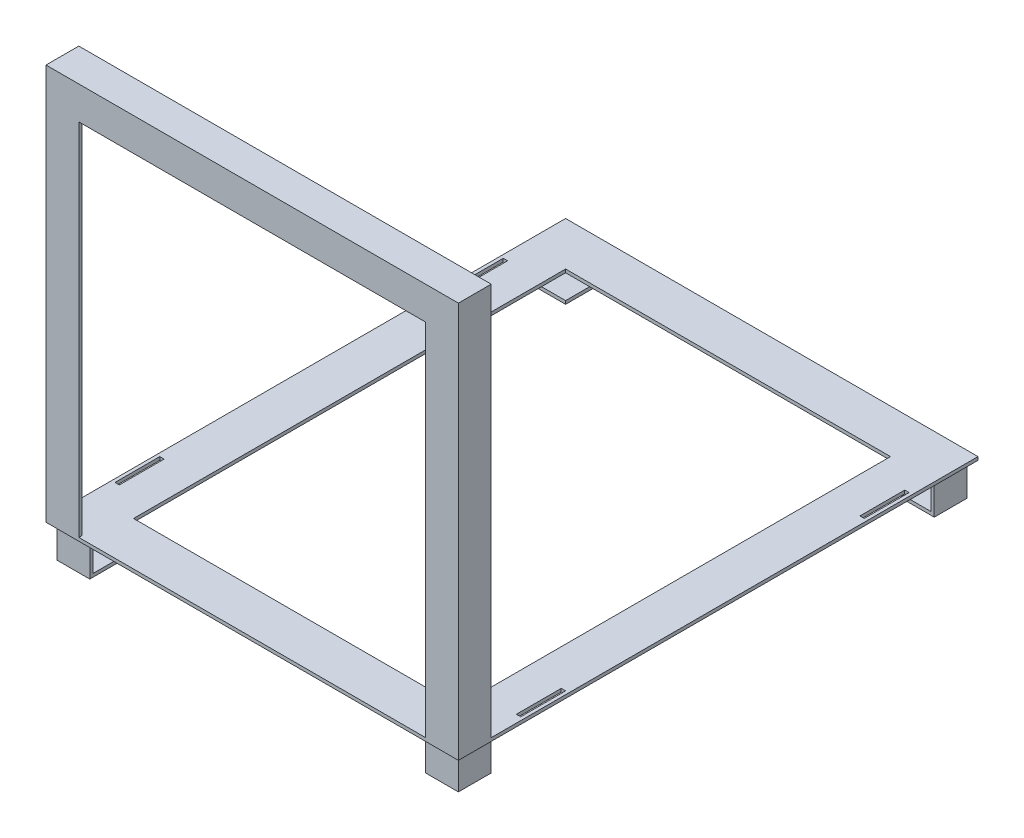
ISO-10303-21;
HEADER;
FILE_DESCRIPTION(('STEP AP214'),'2;1');
FILE_NAME('part.step','',(''),(''),'','','');
FILE_SCHEMA(('AUTOMOTIVE_DESIGN { 1 0 10303 214 1 1 1 1 }'));
ENDSEC;
DATA;
#1=APPLICATION_CONTEXT('core data for automotive mechanical design processes');
#2=APPLICATION_PROTOCOL_DEFINITION('international standard','automotive_design',2000,#1);
#3=PRODUCT_CONTEXT('',#1,'mechanical');
#4=PRODUCT('Part','Part','',(#3));
#5=PRODUCT_RELATED_PRODUCT_CATEGORY('part','',(#4));
#6=PRODUCT_DEFINITION_FORMATION('','',#4);
#7=PRODUCT_DEFINITION_CONTEXT('part definition',#1,'design');
#8=PRODUCT_DEFINITION('design','',#6,#7);
#9=PRODUCT_DEFINITION_SHAPE('','',#8);
#10=(LENGTH_UNIT() NAMED_UNIT(*) SI_UNIT(.MILLI.,.METRE.));
#11=(NAMED_UNIT(*) PLANE_ANGLE_UNIT() SI_UNIT($,.RADIAN.));
#12=(NAMED_UNIT(*) SI_UNIT($,.STERADIAN.) SOLID_ANGLE_UNIT());
#13=UNCERTAINTY_MEASURE_WITH_UNIT(LENGTH_MEASURE(1.E-05),#10,'distance_accuracy_value','');
#14=(GEOMETRIC_REPRESENTATION_CONTEXT(3) GLOBAL_UNCERTAINTY_ASSIGNED_CONTEXT((#13)) GLOBAL_UNIT_ASSIGNED_CONTEXT((#10,
#11,#12)) REPRESENTATION_CONTEXT('',''));
#15=CARTESIAN_POINT('',(0.,0.,0.));
#16=DIRECTION('',(0.,0.,1.));
#17=DIRECTION('',(1.,0.,0.));
#18=AXIS2_PLACEMENT_3D('',#15,#16,#17);
#19=CARTESIAN_POINT('',(0.,357.5,0.));
#20=DIRECTION('',(0.,1.,0.));
#21=DIRECTION('',(0.,0.,1.));
#22=AXIS2_PLACEMENT_3D('',#19,#20,#21);
#23=PLANE('',#22);
#24=DIRECTION('',(-1.,0.,0.));
#25=VECTOR('',#24,1.);
#26=CARTESIAN_POINT('',(158.5,357.5,234.5));
#27=LINE('',#26,#25);
#28=CARTESIAN_POINT('',(185.5,357.5,234.5));
#29=VERTEX_POINT('',#28);
#30=CARTESIAN_POINT('',(-185.5,357.5,234.5));
#31=VERTEX_POINT('',#30);
#32=EDGE_CURVE('E1365',#29,#31,#27,.T.);
#33=ORIENTED_EDGE('',*,*,#32,.T.);
#34=DIRECTION('',(0.,0.,-1.));
#35=VECTOR('',#34,1.);
#36=CARTESIAN_POINT('',(-185.5,357.5,234.5));
#37=LINE('',#36,#35);
#38=CARTESIAN_POINT('',(-185.5,357.5,207.5));
#39=VERTEX_POINT('',#38);
#40=EDGE_CURVE('E1363',#31,#39,#37,.T.);
#41=ORIENTED_EDGE('',*,*,#40,.T.);
#42=DIRECTION('',(-1.,0.,0.));
#43=VECTOR('',#42,1.);
#44=CARTESIAN_POINT('',(-188.5,357.5,207.5));
#45=LINE('',#44,#43);
#46=CARTESIAN_POINT('',(185.5,357.5,207.5));
#47=VERTEX_POINT('',#46);
#48=EDGE_CURVE('E1361',#47,#39,#45,.T.);
#49=ORIENTED_EDGE('',*,*,#48,.F.);
#50=DIRECTION('',(0.,0.,1.));
#51=VECTOR('',#50,1.);
#52=CARTESIAN_POINT('',(185.5,357.5,234.5));
#53=LINE('',#52,#51);
#54=EDGE_CURVE('E1345',#47,#29,#53,.T.);
#55=ORIENTED_EDGE('',*,*,#54,.T.);
#56=EDGE_LOOP('',(#33,#41,#49,#55));
#57=FACE_BOUND('',#56,.T.);
#58=ADVANCED_FACE('F39',(#57),#23,.F.);
#59=CARTESIAN_POINT('',(185.5,360.5,234.5));
#60=DIRECTION('',(1.,0.,0.));
#61=DIRECTION('',(0.,0.,-1.));
#62=AXIS2_PLACEMENT_3D('',#59,#60,#61);
#63=PLANE('',#62);
#64=ORIENTED_EDGE('',*,*,#54,.F.);
#65=DIRECTION('',(0.,-1.,0.));
#66=VECTOR('',#65,1.);
#67=CARTESIAN_POINT('',(185.5,360.5,207.5));
#68=LINE('',#67,#66);
#69=CARTESIAN_POINT('',(185.5,1.5,207.5));
#70=VERTEX_POINT('',#69);
#71=EDGE_CURVE('E496',#47,#70,#68,.T.);
#72=ORIENTED_EDGE('',*,*,#71,.T.);
#73=DIRECTION('',(0.,0.,1.));
#74=VECTOR('',#73,1.);
#75=CARTESIAN_POINT('',(185.5,1.5,234.5));
#76=LINE('',#75,#74);
#77=CARTESIAN_POINT('',(185.5,1.5,234.5));
#78=VERTEX_POINT('',#77);
#79=EDGE_CURVE('E461',#70,#78,#76,.T.);
#80=ORIENTED_EDGE('',*,*,#79,.T.);
#81=DIRECTION('',(0.,-1.,0.));
#82=VECTOR('',#81,1.);
#83=CARTESIAN_POINT('',(185.5,360.5,234.5));
#84=LINE('',#83,#82);
#85=EDGE_CURVE('E493',#29,#78,#84,.T.);
#86=ORIENTED_EDGE('',*,*,#85,.F.);
#87=EDGE_LOOP('',(#64,#72,#80,#86));
#88=FACE_BOUND('',#87,.T.);
#89=ADVANCED_FACE('F1098',(#88),#63,.F.);
#90=CARTESIAN_POINT('',(158.5,360.5,237.5));
#91=DIRECTION('',(1.,0.,0.));
#92=DIRECTION('',(0.,0.,-1.));
#93=AXIS2_PLACEMENT_3D('',#90,#91,#92);
#94=PLANE('',#93);
#95=DIRECTION('',(0.,-1.,0.));
#96=VECTOR('',#95,1.);
#97=CARTESIAN_POINT('',(158.5,360.5,237.5));
#98=LINE('',#97,#96);
#99=CARTESIAN_POINT('',(158.5,330.5,237.5));
#100=VERTEX_POINT('',#99);
#101=CARTESIAN_POINT('',(158.5,1.5,237.5));
#102=VERTEX_POINT('',#101);
#103=EDGE_CURVE('E476',#100,#102,#98,.T.);
#104=ORIENTED_EDGE('',*,*,#103,.F.);
#105=DIRECTION('',(0.,0.,-1.));
#106=VECTOR('',#105,1.);
#107=CARTESIAN_POINT('',(158.5,330.5,237.5));
#108=LINE('',#107,#106);
#109=CARTESIAN_POINT('',(158.5,330.5,234.5));
#110=VERTEX_POINT('',#109);
#111=EDGE_CURVE('E436',#100,#110,#108,.T.);
#112=ORIENTED_EDGE('',*,*,#111,.T.);
#113=DIRECTION('',(0.,-1.,0.));
#114=VECTOR('',#113,1.);
#115=CARTESIAN_POINT('',(158.5,360.5,234.5));
#116=LINE('',#115,#114);
#117=CARTESIAN_POINT('',(158.5,1.5,234.5));
#118=VERTEX_POINT('',#117);
#119=EDGE_CURVE('E490',#110,#118,#116,.T.);
#120=ORIENTED_EDGE('',*,*,#119,.T.);
#121=DIRECTION('',(0.,0.,1.));
#122=VECTOR('',#121,1.);
#123=CARTESIAN_POINT('',(158.5,1.5,237.5));
#124=LINE('',#123,#122);
#125=EDGE_CURVE('E470',#118,#102,#124,.T.);
#126=ORIENTED_EDGE('',*,*,#125,.T.);
#127=EDGE_LOOP('',(#104,#112,#120,#126));
#128=FACE_BOUND('',#127,.T.);
#129=ADVANCED_FACE('F1105',(#128),#94,.F.);
#130=CARTESIAN_POINT('',(-158.5,360.5,237.5));
#131=DIRECTION('',(-1.,0.,0.));
#132=DIRECTION('',(0.,0.,1.));
#133=AXIS2_PLACEMENT_3D('',#130,#131,#132);
#134=PLANE('',#133);
#135=DIRECTION('',(0.,-1.,0.));
#136=VECTOR('',#135,1.);
#137=CARTESIAN_POINT('',(-158.5,360.5,234.5));
#138=LINE('',#137,#136);
#139=CARTESIAN_POINT('',(-158.5,330.5,234.5));
#140=VERTEX_POINT('',#139);
#141=CARTESIAN_POINT('',(-158.5,1.5,234.5));
#142=VERTEX_POINT('',#141);
#143=EDGE_CURVE('E55',#140,#142,#138,.T.);
#144=ORIENTED_EDGE('',*,*,#143,.F.);
#145=DIRECTION('',(0.,0.,1.));
#146=VECTOR('',#145,1.);
#147=CARTESIAN_POINT('',(-158.5,330.5,237.5));
#148=LINE('',#147,#146);
#149=CARTESIAN_POINT('',(-158.5,330.5,237.5));
#150=VERTEX_POINT('',#149);
#151=EDGE_CURVE('E434',#140,#150,#148,.T.);
#152=ORIENTED_EDGE('',*,*,#151,.T.);
#153=DIRECTION('',(0.,-1.,0.));
#154=VECTOR('',#153,1.);
#155=CARTESIAN_POINT('',(-158.5,360.5,237.5));
#156=LINE('',#155,#154);
#157=CARTESIAN_POINT('',(-158.5,1.5,237.5));
#158=VERTEX_POINT('',#157);
#159=EDGE_CURVE('E446',#150,#158,#156,.T.);
#160=ORIENTED_EDGE('',*,*,#159,.T.);
#161=DIRECTION('',(0.,0.,-1.));
#162=VECTOR('',#161,1.);
#163=CARTESIAN_POINT('',(-158.5,1.5,237.5));
#164=LINE('',#163,#162);
#165=EDGE_CURVE('E1347',#158,#142,#164,.T.);
#166=ORIENTED_EDGE('',*,*,#165,.T.);
#167=EDGE_LOOP('',(#144,#152,#160,#166));
#168=FACE_BOUND('',#167,.T.);
#169=ADVANCED_FACE('F444',(#168),#134,.F.);
#170=CARTESIAN_POINT('',(-158.5,360.5,234.5));
#171=DIRECTION('',(0.,0.,1.));
#172=DIRECTION('',(1.,0.,0.));
#173=AXIS2_PLACEMENT_3D('',#170,#171,#172);
#174=PLANE('',#173);
#175=DIRECTION('',(-1.,0.,0.));
#176=VECTOR('',#175,1.);
#177=CARTESIAN_POINT('',(-158.5,1.5,234.5));
#178=LINE('',#177,#176);
#179=CARTESIAN_POINT('',(-185.5,1.5,234.5));
#180=VERTEX_POINT('',#179);
#181=EDGE_CURVE('E1350',#142,#180,#178,.T.);
#182=ORIENTED_EDGE('',*,*,#181,.T.);
#183=DIRECTION('',(0.,-1.,0.));
#184=VECTOR('',#183,1.);
#185=CARTESIAN_POINT('',(-185.5,360.5,234.5));
#186=LINE('',#185,#184);
#187=EDGE_CURVE('E63',#31,#180,#186,.T.);
#188=ORIENTED_EDGE('',*,*,#187,.F.);
#189=ORIENTED_EDGE('',*,*,#32,.F.);
#190=ORIENTED_EDGE('',*,*,#85,.T.);
#191=DIRECTION('',(-1.,0.,0.));
#192=VECTOR('',#191,1.);
#193=CARTESIAN_POINT('',(158.5,1.5,234.5));
#194=LINE('',#193,#192);
#195=EDGE_CURVE('E481',#78,#118,#194,.T.);
#196=ORIENTED_EDGE('',*,*,#195,.T.);
#197=ORIENTED_EDGE('',*,*,#119,.F.);
#198=DIRECTION('',(1.,0.,0.));
#199=VECTOR('',#198,1.);
#200=CARTESIAN_POINT('',(-188.5,330.5,234.5));
#201=LINE('',#200,#199);
#202=EDGE_CURVE('E441',#140,#110,#201,.T.);
#203=ORIENTED_EDGE('',*,*,#202,.F.);
#204=ORIENTED_EDGE('',*,*,#143,.T.);
#205=EDGE_LOOP('',(#182,#188,#189,#190,#196,#197,#203,#204));
#206=FACE_BOUND('',#205,.T.);
#207=ADVANCED_FACE('F1114',(#206),#174,.F.);
#208=CARTESIAN_POINT('',(-185.5,360.5,234.5));
#209=DIRECTION('',(-1.,0.,0.));
#210=DIRECTION('',(0.,0.,1.));
#211=AXIS2_PLACEMENT_3D('',#208,#209,#210);
#212=PLANE('',#211);
#213=ORIENTED_EDGE('',*,*,#40,.F.);
#214=ORIENTED_EDGE('',*,*,#187,.T.);
#215=DIRECTION('',(0.,0.,-1.));
#216=VECTOR('',#215,1.);
#217=CARTESIAN_POINT('',(-185.5,1.5,234.5));
#218=LINE('',#217,#216);
#219=CARTESIAN_POINT('',(-185.5,1.5,207.5));
#220=VERTEX_POINT('',#219);
#221=EDGE_CURVE('E1341',#180,#220,#218,.T.);
#222=ORIENTED_EDGE('',*,*,#221,.T.);
#223=DIRECTION('',(0.,-1.,0.));
#224=VECTOR('',#223,1.);
#225=CARTESIAN_POINT('',(-185.5,360.5,207.5));
#226=LINE('',#225,#224);
#227=EDGE_CURVE('E1338',#39,#220,#226,.T.);
#228=ORIENTED_EDGE('',*,*,#227,.F.);
#229=EDGE_LOOP('',(#213,#214,#222,#228));
#230=FACE_BOUND('',#229,.T.);
#231=ADVANCED_FACE('F1110',(#230),#212,.F.);
#232=CARTESIAN_POINT('',(0.,1.5,0.));
#233=DIRECTION('',(0.,1.,0.));
#234=DIRECTION('',(0.,0.,1.));
#235=AXIS2_PLACEMENT_3D('',#232,#233,#234);
#236=PLANE('',#235);
#237=DIRECTION('',(0.,0.,-1.));
#238=VECTOR('',#237,1.);
#239=CARTESIAN_POINT('',(185.5,1.5,-136.5));
#240=LINE('',#239,#238);
#241=CARTESIAN_POINT('',(185.5,1.5,-136.5));
#242=VERTEX_POINT('',#241);
#243=CARTESIAN_POINT('',(185.5,1.5,-177.5));
#244=VERTEX_POINT('',#243);
#245=EDGE_CURVE('E852',#242,#244,#240,.T.);
#246=ORIENTED_EDGE('',*,*,#245,.F.);
#247=DIRECTION('',(1.,0.,0.));
#248=VECTOR('',#247,1.);
#249=CARTESIAN_POINT('',(181.5,1.5,-136.5));
#250=LINE('',#249,#248);
#251=CARTESIAN_POINT('',(181.5,1.5,-136.5));
#252=VERTEX_POINT('',#251);
#253=EDGE_CURVE('E839',#252,#242,#250,.T.);
#254=ORIENTED_EDGE('',*,*,#253,.F.);
#255=DIRECTION('',(0.,0.,1.));
#256=VECTOR('',#255,1.);
#257=CARTESIAN_POINT('',(181.5,1.5,-136.5));
#258=LINE('',#257,#256);
#259=CARTESIAN_POINT('',(181.5,1.5,-177.5));
#260=VERTEX_POINT('',#259);
#261=EDGE_CURVE('E860',#260,#252,#258,.T.);
#262=ORIENTED_EDGE('',*,*,#261,.F.);
#263=DIRECTION('',(-1.,0.,0.));
#264=VECTOR('',#263,1.);
#265=CARTESIAN_POINT('',(181.5,1.5,-177.5));
#266=LINE('',#265,#264);
#267=EDGE_CURVE('E855',#244,#260,#266,.T.);
#268=ORIENTED_EDGE('',*,*,#267,.F.);
#269=EDGE_LOOP('',(#246,#254,#262,#268));
#270=FACE_BOUND('',#269,.T.);
#271=DIRECTION('',(0.,0.,-1.));
#272=VECTOR('',#271,1.);
#273=CARTESIAN_POINT('',(-181.5,1.5,177.5));
#274=LINE('',#273,#272);
#275=CARTESIAN_POINT('',(-181.5,1.5,177.5));
#276=VERTEX_POINT('',#275);
#277=CARTESIAN_POINT('',(-181.5,1.5,136.5));
#278=VERTEX_POINT('',#277);
#279=EDGE_CURVE('E824',#276,#278,#274,.T.);
#280=ORIENTED_EDGE('',*,*,#279,.F.);
#281=DIRECTION('',(1.,0.,0.));
#282=VECTOR('',#281,1.);
#283=CARTESIAN_POINT('',(-185.5,1.5,177.5));
#284=LINE('',#283,#282);
#285=CARTESIAN_POINT('',(-185.5,1.5,177.5));
#286=VERTEX_POINT('',#285);
#287=EDGE_CURVE('E885',#286,#276,#284,.T.);
#288=ORIENTED_EDGE('',*,*,#287,.F.);
#289=DIRECTION('',(0.,0.,1.));
#290=VECTOR('',#289,1.);
#291=CARTESIAN_POINT('',(-185.5,1.5,177.5));
#292=LINE('',#291,#290);
#293=CARTESIAN_POINT('',(-185.5,1.5,136.5));
#294=VERTEX_POINT('',#293);
#295=EDGE_CURVE('E904',#294,#286,#292,.T.);
#296=ORIENTED_EDGE('',*,*,#295,.F.);
#297=DIRECTION('',(-1.,0.,0.));
#298=VECTOR('',#297,1.);
#299=CARTESIAN_POINT('',(-185.5,1.5,136.5));
#300=LINE('',#299,#298);
#301=EDGE_CURVE('E900',#278,#294,#300,.T.);
#302=ORIENTED_EDGE('',*,*,#301,.F.);
#303=EDGE_LOOP('',(#280,#288,#296,#302));
#304=FACE_BOUND('',#303,.T.);
#305=DIRECTION('',(0.,0.,-1.));
#306=VECTOR('',#305,1.);
#307=CARTESIAN_POINT('',(-181.5,1.5,-136.5));
#308=LINE('',#307,#306);
#309=CARTESIAN_POINT('',(-181.5,1.5,-136.5));
#310=VERTEX_POINT('',#309);
#311=CARTESIAN_POINT('',(-181.5,1.5,-177.5));
#312=VERTEX_POINT('',#311);
#313=EDGE_CURVE('E789',#310,#312,#308,.T.);
#314=ORIENTED_EDGE('',*,*,#313,.F.);
#315=DIRECTION('',(1.,0.,0.));
#316=VECTOR('',#315,1.);
#317=CARTESIAN_POINT('',(-185.5,1.5,-136.5));
#318=LINE('',#317,#316);
#319=CARTESIAN_POINT('',(-185.5,1.5,-136.5));
#320=VERTEX_POINT('',#319);
#321=EDGE_CURVE('E795',#320,#310,#318,.T.);
#322=ORIENTED_EDGE('',*,*,#321,.F.);
#323=DIRECTION('',(0.,0.,1.));
#324=VECTOR('',#323,1.);
#325=CARTESIAN_POINT('',(-185.5,1.5,-136.5));
#326=LINE('',#325,#324);
#327=CARTESIAN_POINT('',(-185.5,1.5,-177.5));
#328=VERTEX_POINT('',#327);
#329=EDGE_CURVE('E814',#328,#320,#326,.T.);
#330=ORIENTED_EDGE('',*,*,#329,.F.);
#331=DIRECTION('',(-1.,0.,0.));
#332=VECTOR('',#331,1.);
#333=CARTESIAN_POINT('',(-185.5,1.5,-177.5));
#334=LINE('',#333,#332);
#335=EDGE_CURVE('E810',#312,#328,#334,.T.);
#336=ORIENTED_EDGE('',*,*,#335,.F.);
#337=EDGE_LOOP('',(#314,#322,#330,#336));
#338=FACE_BOUND('',#337,.T.);
#339=DIRECTION('',(0.,0.,-1.));
#340=VECTOR('',#339,1.);
#341=CARTESIAN_POINT('',(185.5,1.5,177.5));
#342=LINE('',#341,#340);
#343=CARTESIAN_POINT('',(185.5,1.5,177.5));
#344=VERTEX_POINT('',#343);
#345=CARTESIAN_POINT('',(185.5,1.5,136.5));
#346=VERTEX_POINT('',#345);
#347=EDGE_CURVE('E870',#344,#346,#342,.T.);
#348=ORIENTED_EDGE('',*,*,#347,.F.);
#349=DIRECTION('',(1.,0.,0.));
#350=VECTOR('',#349,1.);
#351=CARTESIAN_POINT('',(181.5,1.5,177.5));
#352=LINE('',#351,#350);
#353=CARTESIAN_POINT('',(181.5,1.5,177.5));
#354=VERTEX_POINT('',#353);
#355=EDGE_CURVE('E927',#354,#344,#352,.T.);
#356=ORIENTED_EDGE('',*,*,#355,.F.);
#357=DIRECTION('',(0.,0.,1.));
#358=VECTOR('',#357,1.);
#359=CARTESIAN_POINT('',(181.5,1.5,177.5));
#360=LINE('',#359,#358);
#361=CARTESIAN_POINT('',(181.5,1.5,136.5));
#362=VERTEX_POINT('',#361);
#363=EDGE_CURVE('E946',#362,#354,#360,.T.);
#364=ORIENTED_EDGE('',*,*,#363,.F.);
#365=DIRECTION('',(-1.,0.,0.));
#366=VECTOR('',#365,1.);
#367=CARTESIAN_POINT('',(181.5,1.5,136.5));
#368=LINE('',#367,#366);
#369=EDGE_CURVE('E942',#346,#362,#368,.T.);
#370=ORIENTED_EDGE('',*,*,#369,.F.);
#371=EDGE_LOOP('',(#348,#356,#364,#370));
#372=FACE_BOUND('',#371,.T.);
#373=DIRECTION('',(1.,0.,0.));
#374=VECTOR('',#373,1.);
#375=CARTESIAN_POINT('',(-148.5,1.5,197.5));
#376=LINE('',#375,#374);
#377=CARTESIAN_POINT('',(-148.5,1.5,197.5));
#378=VERTEX_POINT('',#377);
#379=CARTESIAN_POINT('',(148.5,1.5,197.5));
#380=VERTEX_POINT('',#379);
#381=EDGE_CURVE('E969',#378,#380,#376,.T.);
#382=ORIENTED_EDGE('',*,*,#381,.F.);
#383=DIRECTION('',(0.,0.,1.));
#384=VECTOR('',#383,1.);
#385=CARTESIAN_POINT('',(-148.5,1.5,-197.5));
#386=LINE('',#385,#384);
#387=CARTESIAN_POINT('',(-148.5,1.5,-197.5));
#388=VERTEX_POINT('',#387);
#389=EDGE_CURVE('E966',#388,#378,#386,.T.);
#390=ORIENTED_EDGE('',*,*,#389,.F.);
#391=DIRECTION('',(-1.,0.,0.));
#392=VECTOR('',#391,1.);
#393=CARTESIAN_POINT('',(-148.5,1.5,-197.5));
#394=LINE('',#393,#392);
#395=CARTESIAN_POINT('',(148.5,1.5,-197.5));
#396=VERTEX_POINT('',#395);
#397=EDGE_CURVE('E977',#396,#388,#394,.T.);
#398=ORIENTED_EDGE('',*,*,#397,.F.);
#399=DIRECTION('',(0.,0.,-1.));
#400=VECTOR('',#399,1.);
#401=CARTESIAN_POINT('',(148.5,1.5,-197.5));
#402=LINE('',#401,#400);
#403=EDGE_CURVE('E973',#380,#396,#402,.T.);
#404=ORIENTED_EDGE('',*,*,#403,.F.);
#405=EDGE_LOOP('',(#382,#390,#398,#404));
#406=FACE_BOUND('',#405,.T.);
#407=ORIENTED_EDGE('',*,*,#181,.F.);
#408=ORIENTED_EDGE('',*,*,#165,.F.);
#409=DIRECTION('',(1.,0.,0.));
#410=VECTOR('',#409,1.);
#411=CARTESIAN_POINT('',(-188.5,1.5,237.5));
#412=LINE('',#411,#410);
#413=EDGE_CURVE('E453',#158,#102,#412,.T.);
#414=ORIENTED_EDGE('',*,*,#413,.T.);
#415=ORIENTED_EDGE('',*,*,#125,.F.);
#416=ORIENTED_EDGE('',*,*,#195,.F.);
#417=ORIENTED_EDGE('',*,*,#79,.F.);
#418=DIRECTION('',(-1.,0.,0.));
#419=VECTOR('',#418,1.);
#420=CARTESIAN_POINT('',(185.5,1.5,207.5));
#421=LINE('',#420,#419);
#422=CARTESIAN_POINT('',(188.5,1.5,207.5));
#423=VERTEX_POINT('',#422);
#424=EDGE_CURVE('E456',#423,#70,#421,.T.);
#425=ORIENTED_EDGE('',*,*,#424,.F.);
#426=DIRECTION('',(0.,0.,-1.));
#427=VECTOR('',#426,1.);
#428=CARTESIAN_POINT('',(188.5,1.5,-237.5));
#429=LINE('',#428,#427);
#430=CARTESIAN_POINT('',(188.5,1.5,-237.5));
#431=VERTEX_POINT('',#430);
#432=EDGE_CURVE('E1009',#423,#431,#429,.T.);
#433=ORIENTED_EDGE('',*,*,#432,.T.);
#434=DIRECTION('',(-1.,0.,0.));
#435=VECTOR('',#434,1.);
#436=CARTESIAN_POINT('',(-188.5,1.5,-237.5));
#437=LINE('',#436,#435);
#438=CARTESIAN_POINT('',(-188.5,1.5,-237.5));
#439=VERTEX_POINT('',#438);
#440=EDGE_CURVE('E1012',#431,#439,#437,.T.);
#441=ORIENTED_EDGE('',*,*,#440,.T.);
#442=DIRECTION('',(0.,0.,1.));
#443=VECTOR('',#442,1.);
#444=CARTESIAN_POINT('',(-188.5,1.5,-237.5));
#445=LINE('',#444,#443);
#446=CARTESIAN_POINT('',(-188.5,1.5,207.5));
#447=VERTEX_POINT('',#446);
#448=EDGE_CURVE('E1016',#439,#447,#445,.T.);
#449=ORIENTED_EDGE('',*,*,#448,.T.);
#450=DIRECTION('',(-1.,0.,0.));
#451=VECTOR('',#450,1.);
#452=CARTESIAN_POINT('',(-185.5,1.5,207.5));
#453=LINE('',#452,#451);
#454=EDGE_CURVE('E1334',#220,#447,#453,.T.);
#455=ORIENTED_EDGE('',*,*,#454,.F.);
#456=ORIENTED_EDGE('',*,*,#221,.F.);
#457=EDGE_LOOP('',(#407,#408,#414,#415,#416,#417,#425,#433,#441,#449,#455,#456));
#458=FACE_BOUND('',#457,.T.);
#459=ADVANCED_FACE('F1113',(#270,#304,#338,#372,#406,#458),#236,.T.);
#460=CARTESIAN_POINT('',(-180.5,-31.5,202.5));
#461=DIRECTION('',(-1.,0.,0.));
#462=DIRECTION('',(0.,0.,1.));
#463=AXIS2_PLACEMENT_3D('',#460,#461,#462);
#464=PLANE('',#463);
#465=DIRECTION('',(0.,0.,1.));
#466=VECTOR('',#465,1.);
#467=CARTESIAN_POINT('',(-180.5,-28.5,202.5));
#468=LINE('',#467,#466);
#469=CARTESIAN_POINT('',(-180.5,-28.5,202.5));
#470=VERTEX_POINT('',#469);
#471=CARTESIAN_POINT('',(-180.5,-28.5,229.5));
#472=VERTEX_POINT('',#471);
#473=EDGE_CURVE('E516',#470,#472,#468,.T.);
#474=ORIENTED_EDGE('',*,*,#473,.F.);
#475=DIRECTION('',(0.,1.,0.));
#476=VECTOR('',#475,1.);
#477=CARTESIAN_POINT('',(-180.5,-31.5,202.5));
#478=LINE('',#477,#476);
#479=CARTESIAN_POINT('',(-180.5,-1.5,202.5));
#480=VERTEX_POINT('',#479);
#481=EDGE_CURVE('E780',#470,#480,#478,.T.);
#482=ORIENTED_EDGE('',*,*,#481,.T.);
#483=DIRECTION('',(0.,0.,1.));
#484=VECTOR('',#483,1.);
#485=CARTESIAN_POINT('',(-180.5,-1.5,202.5));
#486=LINE('',#485,#484);
#487=CARTESIAN_POINT('',(-180.5,-1.5,229.5));
#488=VERTEX_POINT('',#487);
#489=EDGE_CURVE('E761',#480,#488,#486,.T.);
#490=ORIENTED_EDGE('',*,*,#489,.T.);
#491=DIRECTION('',(0.,1.,0.));
#492=VECTOR('',#491,1.);
#493=CARTESIAN_POINT('',(-180.5,-31.5,229.5));
#494=LINE('',#493,#492);
#495=EDGE_CURVE('E777',#472,#488,#494,.T.);
#496=ORIENTED_EDGE('',*,*,#495,.F.);
#497=EDGE_LOOP('',(#474,#482,#490,#496));
#498=FACE_BOUND('',#497,.T.);
#499=ADVANCED_FACE('F1204',(#498),#464,.F.);
#500=CARTESIAN_POINT('',(-180.5,-31.5,229.5));
#501=DIRECTION('',(0.,0.,1.));
#502=DIRECTION('',(1.,0.,0.));
#503=AXIS2_PLACEMENT_3D('',#500,#501,#502);
#504=PLANE('',#503);
#505=DIRECTION('',(1.,0.,0.));
#506=VECTOR('',#505,1.);
#507=CARTESIAN_POINT('',(-180.5,-28.5,229.5));
#508=LINE('',#507,#506);
#509=CARTESIAN_POINT('',(-153.5,-28.5,229.5));
#510=VERTEX_POINT('',#509);
#511=EDGE_CURVE('E513',#472,#510,#508,.T.);
#512=ORIENTED_EDGE('',*,*,#511,.F.);
#513=ORIENTED_EDGE('',*,*,#495,.T.);
#514=DIRECTION('',(1.,0.,0.));
#515=VECTOR('',#514,1.);
#516=CARTESIAN_POINT('',(-180.5,-1.5,229.5));
#517=LINE('',#516,#515);
#518=CARTESIAN_POINT('',(-153.5,-1.5,229.5));
#519=VERTEX_POINT('',#518);
#520=EDGE_CURVE('E765',#488,#519,#517,.T.);
#521=ORIENTED_EDGE('',*,*,#520,.T.);
#522=DIRECTION('',(0.,1.,0.));
#523=VECTOR('',#522,1.);
#524=CARTESIAN_POINT('',(-153.5,-31.5,229.5));
#525=LINE('',#524,#523);
#526=EDGE_CURVE('E774',#510,#519,#525,.T.);
#527=ORIENTED_EDGE('',*,*,#526,.F.);
#528=EDGE_LOOP('',(#512,#513,#521,#527));
#529=FACE_BOUND('',#528,.T.);
#530=ADVANCED_FACE('F1200',(#529),#504,.F.);
#531=CARTESIAN_POINT('',(180.5,-31.5,-229.5));
#532=DIRECTION('',(0.,0.,-1.));
#533=DIRECTION('',(-1.,0.,0.));
#534=AXIS2_PLACEMENT_3D('',#531,#532,#533);
#535=PLANE('',#534);
#536=DIRECTION('',(-1.,0.,0.));
#537=VECTOR('',#536,1.);
#538=CARTESIAN_POINT('',(180.5,-28.5,-229.5));
#539=LINE('',#538,#537);
#540=CARTESIAN_POINT('',(180.5,-28.5,-229.5));
#541=VERTEX_POINT('',#540);
#542=CARTESIAN_POINT('',(153.5,-28.5,-229.5));
#543=VERTEX_POINT('',#542);
#544=EDGE_CURVE('E549',#541,#543,#539,.T.);
#545=ORIENTED_EDGE('',*,*,#544,.F.);
#546=DIRECTION('',(0.,1.,0.));
#547=VECTOR('',#546,1.);
#548=CARTESIAN_POINT('',(180.5,-31.5,-229.5));
#549=LINE('',#548,#547);
#550=CARTESIAN_POINT('',(180.5,-1.5,-229.5));
#551=VERTEX_POINT('',#550);
#552=EDGE_CURVE('E582',#541,#551,#549,.T.);
#553=ORIENTED_EDGE('',*,*,#552,.T.);
#554=DIRECTION('',(-1.,0.,0.));
#555=VECTOR('',#554,1.);
#556=CARTESIAN_POINT('',(180.5,-1.5,-229.5));
#557=LINE('',#556,#555);
#558=CARTESIAN_POINT('',(153.5,-1.5,-229.5));
#559=VERTEX_POINT('',#558);
#560=EDGE_CURVE('E567',#551,#559,#557,.T.);
#561=ORIENTED_EDGE('',*,*,#560,.T.);
#562=DIRECTION('',(0.,1.,0.));
#563=VECTOR('',#562,1.);
#564=CARTESIAN_POINT('',(153.5,-31.5,-229.5));
#565=LINE('',#564,#563);
#566=EDGE_CURVE('E619',#543,#559,#565,.T.);
#567=ORIENTED_EDGE('',*,*,#566,.F.);
#568=EDGE_LOOP('',(#545,#553,#561,#567));
#569=FACE_BOUND('',#568,.T.);
#570=ADVANCED_FACE('F1203',(#569),#535,.F.);
#571=CARTESIAN_POINT('',(180.5,-31.5,-202.5));
#572=DIRECTION('',(1.,0.,0.));
#573=DIRECTION('',(0.,0.,-1.));
#574=AXIS2_PLACEMENT_3D('',#571,#572,#573);
#575=PLANE('',#574);
#576=DIRECTION('',(0.,0.,-1.));
#577=VECTOR('',#576,1.);
#578=CARTESIAN_POINT('',(180.5,-28.5,-202.5));
#579=LINE('',#578,#577);
#580=CARTESIAN_POINT('',(180.5,-28.5,-202.5));
#581=VERTEX_POINT('',#580);
#582=EDGE_CURVE('E11',#581,#541,#579,.T.);
#583=ORIENTED_EDGE('',*,*,#582,.F.);
#584=DIRECTION('',(0.,1.,0.));
#585=VECTOR('',#584,1.);
#586=CARTESIAN_POINT('',(180.5,-31.5,-202.5));
#587=LINE('',#586,#585);
#588=CARTESIAN_POINT('',(180.5,-1.5,-202.5));
#589=VERTEX_POINT('',#588);
#590=EDGE_CURVE('E607',#581,#589,#587,.T.);
#591=ORIENTED_EDGE('',*,*,#590,.T.);
#592=DIRECTION('',(0.,0.,-1.));
#593=VECTOR('',#592,1.);
#594=CARTESIAN_POINT('',(180.5,-1.5,-202.5));
#595=LINE('',#594,#593);
#596=EDGE_CURVE('E572',#589,#551,#595,.T.);
#597=ORIENTED_EDGE('',*,*,#596,.T.);
#598=ORIENTED_EDGE('',*,*,#552,.F.);
#599=EDGE_LOOP('',(#583,#591,#597,#598));
#600=FACE_BOUND('',#599,.T.);
#601=ADVANCED_FACE('F1305',(#600),#575,.F.);
#602=CARTESIAN_POINT('',(0.,-1.5,0.));
#603=DIRECTION('',(0.,1.,0.));
#604=DIRECTION('',(0.,0.,1.));
#605=AXIS2_PLACEMENT_3D('',#602,#603,#604);
#606=PLANE('',#605);
#607=DIRECTION('',(-1.,0.,0.));
#608=VECTOR('',#607,1.);
#609=CARTESIAN_POINT('',(-180.5,-1.5,-202.5));
#610=LINE('',#609,#608);
#611=CARTESIAN_POINT('',(-180.5,-1.5,-202.5));
#612=VERTEX_POINT('',#611);
#613=CARTESIAN_POINT('',(-183.5,-1.5,-202.5));
#614=VERTEX_POINT('',#613);
#615=EDGE_CURVE('E622',#612,#614,#610,.T.);
#616=ORIENTED_EDGE('',*,*,#615,.F.);
#617=DIRECTION('',(0.,0.,1.));
#618=VECTOR('',#617,1.);
#619=CARTESIAN_POINT('',(-180.5,-1.5,-229.5));
#620=LINE('',#619,#618);
#621=CARTESIAN_POINT('',(-180.5,-1.5,-229.5));
#622=VERTEX_POINT('',#621);
#623=EDGE_CURVE('E628',#622,#612,#620,.T.);
#624=ORIENTED_EDGE('',*,*,#623,.F.);
#625=DIRECTION('',(-1.,0.,0.));
#626=VECTOR('',#625,1.);
#627=CARTESIAN_POINT('',(-153.5,-1.5,-229.5));
#628=LINE('',#627,#626);
#629=CARTESIAN_POINT('',(-153.5,-1.5,-229.5));
#630=VERTEX_POINT('',#629);
#631=EDGE_CURVE('E654',#630,#622,#628,.T.);
#632=ORIENTED_EDGE('',*,*,#631,.F.);
#633=DIRECTION('',(0.,0.,1.));
#634=VECTOR('',#633,1.);
#635=CARTESIAN_POINT('',(-153.5,-1.5,-232.5));
#636=LINE('',#635,#634);
#637=CARTESIAN_POINT('',(-153.5,-1.5,-232.5));
#638=VERTEX_POINT('',#637);
#639=EDGE_CURVE('E650',#638,#630,#636,.T.);
#640=ORIENTED_EDGE('',*,*,#639,.F.);
#641=DIRECTION('',(1.,0.,0.));
#642=VECTOR('',#641,1.);
#643=CARTESIAN_POINT('',(-183.5,-1.5,-232.5));
#644=LINE('',#643,#642);
#645=CARTESIAN_POINT('',(-183.5,-1.5,-232.5));
#646=VERTEX_POINT('',#645);
#647=EDGE_CURVE('E646',#646,#638,#644,.T.);
#648=ORIENTED_EDGE('',*,*,#647,.F.);
#649=DIRECTION('',(0.,0.,-1.));
#650=VECTOR('',#649,1.);
#651=CARTESIAN_POINT('',(-183.5,-1.5,-202.5));
#652=LINE('',#651,#650);
#653=EDGE_CURVE('E642',#614,#646,#652,.T.);
#654=ORIENTED_EDGE('',*,*,#653,.F.);
#655=EDGE_LOOP('',(#616,#624,#632,#640,#648,#654));
#656=FACE_BOUND('',#655,.T.);
#657=DIRECTION('',(-1.,0.,0.));
#658=VECTOR('',#657,1.);
#659=CARTESIAN_POINT('',(-153.5,-1.5,232.5));
#660=LINE('',#659,#658);
#661=CARTESIAN_POINT('',(-153.5,-1.5,232.5));
#662=VERTEX_POINT('',#661);
#663=CARTESIAN_POINT('',(-183.5,-1.5,232.5));
#664=VERTEX_POINT('',#663);
#665=EDGE_CURVE('E733',#662,#664,#660,.T.);
#666=ORIENTED_EDGE('',*,*,#665,.F.);
#667=DIRECTION('',(0.,0.,1.));
#668=VECTOR('',#667,1.);
#669=CARTESIAN_POINT('',(-153.5,-1.5,229.5));
#670=LINE('',#669,#668);
#671=EDGE_CURVE('E739',#519,#662,#670,.T.);
#672=ORIENTED_EDGE('',*,*,#671,.F.);
#673=ORIENTED_EDGE('',*,*,#520,.F.);
#674=ORIENTED_EDGE('',*,*,#489,.F.);
#675=DIRECTION('',(1.,0.,0.));
#676=VECTOR('',#675,1.);
#677=CARTESIAN_POINT('',(-183.5,-1.5,202.5));
#678=LINE('',#677,#676);
#679=CARTESIAN_POINT('',(-183.5,-1.5,202.5));
#680=VERTEX_POINT('',#679);
#681=EDGE_CURVE('E757',#680,#480,#678,.T.);
#682=ORIENTED_EDGE('',*,*,#681,.F.);
#683=DIRECTION('',(0.,0.,-1.));
#684=VECTOR('',#683,1.);
#685=CARTESIAN_POINT('',(-183.5,-1.5,232.5));
#686=LINE('',#685,#684);
#687=EDGE_CURVE('E753',#664,#680,#686,.T.);
#688=ORIENTED_EDGE('',*,*,#687,.F.);
#689=EDGE_LOOP('',(#666,#672,#673,#674,#682,#688));
#690=FACE_BOUND('',#689,.T.);
#691=DIRECTION('',(1.,0.,0.));
#692=VECTOR('',#691,1.);
#693=CARTESIAN_POINT('',(181.5,-1.5,-136.5));
#694=LINE('',#693,#692);
#695=CARTESIAN_POINT('',(181.5,-1.5,-136.5));
#696=VERTEX_POINT('',#695);
#697=CARTESIAN_POINT('',(185.5,-1.5,-136.5));
#698=VERTEX_POINT('',#697);
#699=EDGE_CURVE('E847',#696,#698,#694,.T.);
#700=ORIENTED_EDGE('',*,*,#699,.T.);
#701=DIRECTION('',(0.,0.,-1.));
#702=VECTOR('',#701,1.);
#703=CARTESIAN_POINT('',(185.5,-1.5,-136.5));
#704=LINE('',#703,#702);
#705=CARTESIAN_POINT('',(185.5,-1.5,-177.5));
#706=VERTEX_POINT('',#705);
#707=EDGE_CURVE('E834',#698,#706,#704,.T.);
#708=ORIENTED_EDGE('',*,*,#707,.T.);
#709=DIRECTION('',(-1.,0.,0.));
#710=VECTOR('',#709,1.);
#711=CARTESIAN_POINT('',(181.5,-1.5,-177.5));
#712=LINE('',#711,#710);
#713=CARTESIAN_POINT('',(181.5,-1.5,-177.5));
#714=VERTEX_POINT('',#713);
#715=EDGE_CURVE('E838',#706,#714,#712,.T.);
#716=ORIENTED_EDGE('',*,*,#715,.T.);
#717=DIRECTION('',(0.,0.,1.));
#718=VECTOR('',#717,1.);
#719=CARTESIAN_POINT('',(181.5,-1.5,-136.5));
#720=LINE('',#719,#718);
#721=EDGE_CURVE('E843',#714,#696,#720,.T.);
#722=ORIENTED_EDGE('',*,*,#721,.T.);
#723=EDGE_LOOP('',(#700,#708,#716,#722));
#724=FACE_BOUND('',#723,.T.);
#725=DIRECTION('',(1.,0.,0.));
#726=VECTOR('',#725,1.);
#727=CARTESIAN_POINT('',(-185.5,-1.5,177.5));
#728=LINE('',#727,#726);
#729=CARTESIAN_POINT('',(-185.5,-1.5,177.5));
#730=VERTEX_POINT('',#729);
#731=CARTESIAN_POINT('',(-181.5,-1.5,177.5));
#732=VERTEX_POINT('',#731);
#733=EDGE_CURVE('E893',#730,#732,#728,.T.);
#734=ORIENTED_EDGE('',*,*,#733,.T.);
#735=DIRECTION('',(0.,0.,-1.));
#736=VECTOR('',#735,1.);
#737=CARTESIAN_POINT('',(-181.5,-1.5,177.5));
#738=LINE('',#737,#736);
#739=CARTESIAN_POINT('',(-181.5,-1.5,136.5));
#740=VERTEX_POINT('',#739);
#741=EDGE_CURVE('E880',#732,#740,#738,.T.);
#742=ORIENTED_EDGE('',*,*,#741,.T.);
#743=DIRECTION('',(-1.,0.,0.));
#744=VECTOR('',#743,1.);
#745=CARTESIAN_POINT('',(-185.5,-1.5,136.5));
#746=LINE('',#745,#744);
#747=CARTESIAN_POINT('',(-185.5,-1.5,136.5));
#748=VERTEX_POINT('',#747);
#749=EDGE_CURVE('E884',#740,#748,#746,.T.);
#750=ORIENTED_EDGE('',*,*,#749,.T.);
#751=DIRECTION('',(0.,0.,1.));
#752=VECTOR('',#751,1.);
#753=CARTESIAN_POINT('',(-185.5,-1.5,177.5));
#754=LINE('',#753,#752);
#755=EDGE_CURVE('E889',#748,#730,#754,.T.);
#756=ORIENTED_EDGE('',*,*,#755,.T.);
#757=EDGE_LOOP('',(#734,#742,#750,#756));
#758=FACE_BOUND('',#757,.T.);
#759=DIRECTION('',(1.,0.,0.));
#760=VECTOR('',#759,1.);
#761=CARTESIAN_POINT('',(-185.5,-1.5,-136.5));
#762=LINE('',#761,#760);
#763=CARTESIAN_POINT('',(-185.5,-1.5,-136.5));
#764=VERTEX_POINT('',#763);
#765=CARTESIAN_POINT('',(-181.5,-1.5,-136.5));
#766=VERTEX_POINT('',#765);
#767=EDGE_CURVE('E803',#764,#766,#762,.T.);
#768=ORIENTED_EDGE('',*,*,#767,.T.);
#769=DIRECTION('',(0.,0.,-1.));
#770=VECTOR('',#769,1.);
#771=CARTESIAN_POINT('',(-181.5,-1.5,-136.5));
#772=LINE('',#771,#770);
#773=CARTESIAN_POINT('',(-181.5,-1.5,-177.5));
#774=VERTEX_POINT('',#773);
#775=EDGE_CURVE('E790',#766,#774,#772,.T.);
#776=ORIENTED_EDGE('',*,*,#775,.T.);
#777=DIRECTION('',(-1.,0.,0.));
#778=VECTOR('',#777,1.);
#779=CARTESIAN_POINT('',(-185.5,-1.5,-177.5));
#780=LINE('',#779,#778);
#781=CARTESIAN_POINT('',(-185.5,-1.5,-177.5));
#782=VERTEX_POINT('',#781);
#783=EDGE_CURVE('E794',#774,#782,#780,.T.);
#784=ORIENTED_EDGE('',*,*,#783,.T.);
#785=DIRECTION('',(0.,0.,1.));
#786=VECTOR('',#785,1.);
#787=CARTESIAN_POINT('',(-185.5,-1.5,-136.5));
#788=LINE('',#787,#786);
#789=EDGE_CURVE('E799',#782,#764,#788,.T.);
#790=ORIENTED_EDGE('',*,*,#789,.T.);
#791=EDGE_LOOP('',(#768,#776,#784,#790));
#792=FACE_BOUND('',#791,.T.);
#793=DIRECTION('',(1.,0.,0.));
#794=VECTOR('',#793,1.);
#795=CARTESIAN_POINT('',(181.5,-1.5,177.5));
#796=LINE('',#795,#794);
#797=CARTESIAN_POINT('',(181.5,-1.5,177.5));
#798=VERTEX_POINT('',#797);
#799=CARTESIAN_POINT('',(185.5,-1.5,177.5));
#800=VERTEX_POINT('',#799);
#801=EDGE_CURVE('E935',#798,#800,#796,.T.);
#802=ORIENTED_EDGE('',*,*,#801,.T.);
#803=DIRECTION('',(0.,0.,-1.));
#804=VECTOR('',#803,1.);
#805=CARTESIAN_POINT('',(185.5,-1.5,177.5));
#806=LINE('',#805,#804);
#807=CARTESIAN_POINT('',(185.5,-1.5,136.5));
#808=VERTEX_POINT('',#807);
#809=EDGE_CURVE('E922',#800,#808,#806,.T.);
#810=ORIENTED_EDGE('',*,*,#809,.T.);
#811=DIRECTION('',(-1.,0.,0.));
#812=VECTOR('',#811,1.);
#813=CARTESIAN_POINT('',(181.5,-1.5,136.5));
#814=LINE('',#813,#812);
#815=CARTESIAN_POINT('',(181.5,-1.5,136.5));
#816=VERTEX_POINT('',#815);
#817=EDGE_CURVE('E926',#808,#816,#814,.T.);
#818=ORIENTED_EDGE('',*,*,#817,.T.);
#819=DIRECTION('',(0.,0.,1.));
#820=VECTOR('',#819,1.);
#821=CARTESIAN_POINT('',(181.5,-1.5,177.5));
#822=LINE('',#821,#820);
#823=EDGE_CURVE('E931',#816,#798,#822,.T.);
#824=ORIENTED_EDGE('',*,*,#823,.T.);
#825=EDGE_LOOP('',(#802,#810,#818,#824));
#826=FACE_BOUND('',#825,.T.);
#827=DIRECTION('',(0.,0.,-1.));
#828=VECTOR('',#827,1.);
#829=CARTESIAN_POINT('',(188.5,-1.5,-237.5));
#830=LINE('',#829,#828);
#831=CARTESIAN_POINT('',(188.5,-1.5,237.5));
#832=VERTEX_POINT('',#831);
#833=CARTESIAN_POINT('',(188.5,-1.5,-237.5));
#834=VERTEX_POINT('',#833);
#835=EDGE_CURVE('E1008',#832,#834,#830,.T.);
#836=ORIENTED_EDGE('',*,*,#835,.F.);
#837=DIRECTION('',(1.,0.,0.));
#838=VECTOR('',#837,1.);
#839=CARTESIAN_POINT('',(-188.5,-1.5,237.5));
#840=LINE('',#839,#838);
#841=CARTESIAN_POINT('',(-188.5,-1.5,237.5));
#842=VERTEX_POINT('',#841);
#843=EDGE_CURVE('E1013',#842,#832,#840,.T.);
#844=ORIENTED_EDGE('',*,*,#843,.F.);
#845=DIRECTION('',(0.,0.,1.));
#846=VECTOR('',#845,1.);
#847=CARTESIAN_POINT('',(-188.5,-1.5,-237.5));
#848=LINE('',#847,#846);
#849=CARTESIAN_POINT('',(-188.5,-1.5,-237.5));
#850=VERTEX_POINT('',#849);
#851=EDGE_CURVE('E1029',#850,#842,#848,.T.);
#852=ORIENTED_EDGE('',*,*,#851,.F.);
#853=DIRECTION('',(-1.,0.,0.));
#854=VECTOR('',#853,1.);
#855=CARTESIAN_POINT('',(-188.5,-1.5,-237.5));
#856=LINE('',#855,#854);
#857=EDGE_CURVE('E1026',#834,#850,#856,.T.);
#858=ORIENTED_EDGE('',*,*,#857,.F.);
#859=EDGE_LOOP('',(#836,#844,#852,#858));
#860=FACE_BOUND('',#859,.T.);
#861=DIRECTION('',(0.,0.,1.));
#862=VECTOR('',#861,1.);
#863=CARTESIAN_POINT('',(-148.5,-1.5,-197.5));
#864=LINE('',#863,#862);
#865=CARTESIAN_POINT('',(-148.5,-1.5,-197.5));
#866=VERTEX_POINT('',#865);
#867=CARTESIAN_POINT('',(-148.5,-1.5,197.5));
#868=VERTEX_POINT('',#867);
#869=EDGE_CURVE('E956',#866,#868,#864,.T.);
#870=ORIENTED_EDGE('',*,*,#869,.T.);
#871=DIRECTION('',(1.,0.,0.));
#872=VECTOR('',#871,1.);
#873=CARTESIAN_POINT('',(-148.5,-1.5,197.5));
#874=LINE('',#873,#872);
#875=CARTESIAN_POINT('',(148.5,-1.5,197.5));
#876=VERTEX_POINT('',#875);
#877=EDGE_CURVE('E984',#868,#876,#874,.T.);
#878=ORIENTED_EDGE('',*,*,#877,.T.);
#879=DIRECTION('',(0.,0.,-1.));
#880=VECTOR('',#879,1.);
#881=CARTESIAN_POINT('',(148.5,-1.5,-197.5));
#882=LINE('',#881,#880);
#883=CARTESIAN_POINT('',(148.5,-1.5,-197.5));
#884=VERTEX_POINT('',#883);
#885=EDGE_CURVE('E988',#876,#884,#882,.T.);
#886=ORIENTED_EDGE('',*,*,#885,.T.);
#887=DIRECTION('',(-1.,0.,0.));
#888=VECTOR('',#887,1.);
#889=CARTESIAN_POINT('',(-148.5,-1.5,-197.5));
#890=LINE('',#889,#888);
#891=EDGE_CURVE('E970',#884,#866,#890,.T.);
#892=ORIENTED_EDGE('',*,*,#891,.T.);
#893=EDGE_LOOP('',(#870,#878,#886,#892));
#894=FACE_BOUND('',#893,.T.);
#895=DIRECTION('',(0.,0.,-1.));
#896=VECTOR('',#895,1.);
#897=CARTESIAN_POINT('',(153.5,-1.5,229.5));
#898=LINE('',#897,#896);
#899=CARTESIAN_POINT('',(153.5,-1.5,232.5));
#900=VERTEX_POINT('',#899);
#901=CARTESIAN_POINT('',(153.5,-1.5,229.5));
#902=VERTEX_POINT('',#901);
#903=EDGE_CURVE('E678',#900,#902,#898,.T.);
#904=ORIENTED_EDGE('',*,*,#903,.F.);
#905=DIRECTION('',(-1.,0.,0.));
#906=VECTOR('',#905,1.);
#907=CARTESIAN_POINT('',(153.5,-1.5,232.5));
#908=LINE('',#907,#906);
#909=CARTESIAN_POINT('',(183.5,-1.5,232.5));
#910=VERTEX_POINT('',#909);
#911=EDGE_CURVE('E684',#910,#900,#908,.T.);
#912=ORIENTED_EDGE('',*,*,#911,.F.);
#913=DIRECTION('',(0.,0.,1.));
#914=VECTOR('',#913,1.);
#915=CARTESIAN_POINT('',(183.5,-1.5,232.5));
#916=LINE('',#915,#914);
#917=CARTESIAN_POINT('',(183.5,-1.5,202.5));
#918=VERTEX_POINT('',#917);
#919=EDGE_CURVE('E709',#918,#910,#916,.T.);
#920=ORIENTED_EDGE('',*,*,#919,.F.);
#921=DIRECTION('',(1.,0.,0.));
#922=VECTOR('',#921,1.);
#923=CARTESIAN_POINT('',(183.5,-1.5,202.5));
#924=LINE('',#923,#922);
#925=CARTESIAN_POINT('',(180.499999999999,-1.5,202.5));
#926=VERTEX_POINT('',#925);
#927=EDGE_CURVE('E705',#926,#918,#924,.T.);
#928=ORIENTED_EDGE('',*,*,#927,.F.);
#929=DIRECTION('',(0.,0.,-1.));
#930=VECTOR('',#929,1.);
#931=CARTESIAN_POINT('',(180.499999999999,-1.5,202.5));
#932=LINE('',#931,#930);
#933=CARTESIAN_POINT('',(180.499999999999,-1.5,229.5));
#934=VERTEX_POINT('',#933);
#935=EDGE_CURVE('E701',#934,#926,#932,.T.);
#936=ORIENTED_EDGE('',*,*,#935,.F.);
#937=DIRECTION('',(1.,0.,0.));
#938=VECTOR('',#937,1.);
#939=CARTESIAN_POINT('',(180.499999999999,-1.5,229.5));
#940=LINE('',#939,#938);
#941=EDGE_CURVE('E697',#902,#934,#940,.T.);
#942=ORIENTED_EDGE('',*,*,#941,.F.);
#943=EDGE_LOOP('',(#904,#912,#920,#928,#936,#942));
#944=FACE_BOUND('',#943,.T.);
#945=ORIENTED_EDGE('',*,*,#560,.F.);
#946=ORIENTED_EDGE('',*,*,#596,.F.);
#947=DIRECTION('',(-1.,0.,0.));
#948=VECTOR('',#947,1.);
#949=CARTESIAN_POINT('',(183.5,-1.5,-202.5));
#950=LINE('',#949,#948);
#951=CARTESIAN_POINT('',(183.5,-1.5,-202.5));
#952=VERTEX_POINT('',#951);
#953=EDGE_CURVE('E598',#952,#589,#950,.T.);
#954=ORIENTED_EDGE('',*,*,#953,.F.);
#955=DIRECTION('',(0.,0.,1.));
#956=VECTOR('',#955,1.);
#957=CARTESIAN_POINT('',(183.5,-1.5,-232.5));
#958=LINE('',#957,#956);
#959=CARTESIAN_POINT('',(183.5,-1.5,-232.5));
#960=VERTEX_POINT('',#959);
#961=EDGE_CURVE('E594',#960,#952,#958,.T.);
#962=ORIENTED_EDGE('',*,*,#961,.F.);
#963=DIRECTION('',(1.,0.,0.));
#964=VECTOR('',#963,1.);
#965=CARTESIAN_POINT('',(153.5,-1.5,-232.5));
#966=LINE('',#965,#964);
#967=CARTESIAN_POINT('',(153.5,-1.5,-232.5));
#968=VERTEX_POINT('',#967);
#969=EDGE_CURVE('E590',#968,#960,#966,.T.);
#970=ORIENTED_EDGE('',*,*,#969,.F.);
#971=DIRECTION('',(0.,0.,-1.));
#972=VECTOR('',#971,1.);
#973=CARTESIAN_POINT('',(153.5,-1.5,-229.5));
#974=LINE('',#973,#972);
#975=EDGE_CURVE('E586',#559,#968,#974,.T.);
#976=ORIENTED_EDGE('',*,*,#975,.F.);
#977=EDGE_LOOP('',(#945,#946,#954,#962,#970,#976));
#978=FACE_BOUND('',#977,.T.);
#979=ADVANCED_FACE('F1064',(#656,#690,#724,#758,#792,#826,#860,#894,#944,#978),#606,.F.);
#980=CARTESIAN_POINT('',(188.5,1.5,-237.5));
#981=DIRECTION('',(-1.,0.,0.));
#982=DIRECTION('',(0.,0.,1.));
#983=AXIS2_PLACEMENT_3D('',#980,#981,#982);
#984=PLANE('',#983);
#985=DIRECTION('',(0.,-1.,0.));
#986=VECTOR('',#985,1.);
#987=CARTESIAN_POINT('',(188.5,1.5,237.5));
#988=LINE('',#987,#986);
#989=CARTESIAN_POINT('',(188.5,360.5,237.5));
#990=VERTEX_POINT('',#989);
#991=EDGE_CURVE('E1022',#990,#832,#988,.T.);
#992=ORIENTED_EDGE('',*,*,#991,.T.);
#993=ORIENTED_EDGE('',*,*,#835,.T.);
#994=DIRECTION('',(0.,-1.,0.));
#995=VECTOR('',#994,1.);
#996=CARTESIAN_POINT('',(188.5,1.5,-237.5));
#997=LINE('',#996,#995);
#998=EDGE_CURVE('E1045',#431,#834,#997,.T.);
#999=ORIENTED_EDGE('',*,*,#998,.F.);
#1000=ORIENTED_EDGE('',*,*,#432,.F.);
#1001=DIRECTION('',(0.,-1.,0.));
#1002=VECTOR('',#1001,1.);
#1003=CARTESIAN_POINT('',(188.5,360.5,207.5));
#1004=LINE('',#1003,#1002);
#1005=CARTESIAN_POINT('',(188.5,360.5,207.5));
#1006=VERTEX_POINT('',#1005);
#1007=EDGE_CURVE('E499',#1006,#423,#1004,.T.);
#1008=ORIENTED_EDGE('',*,*,#1007,.F.);
#1009=DIRECTION('',(0.,0.,-1.));
#1010=VECTOR('',#1009,1.);
#1011=CARTESIAN_POINT('',(188.5,360.5,207.5));
#1012=LINE('',#1011,#1010);
#1013=EDGE_CURVE('E466',#990,#1006,#1012,.T.);
#1014=ORIENTED_EDGE('',*,*,#1013,.F.);
#1015=EDGE_LOOP('',(#992,#993,#999,#1000,#1008,#1014));
#1016=FACE_BOUND('',#1015,.T.);
#1017=ADVANCED_FACE('F41',(#1016),#984,.F.);
#1018=CARTESIAN_POINT('',(-188.5,1.5,-237.5));
#1019=DIRECTION('',(0.,0.,1.));
#1020=DIRECTION('',(1.,0.,0.));
#1021=AXIS2_PLACEMENT_3D('',#1018,#1019,#1020);
#1022=PLANE('',#1021);
#1023=ORIENTED_EDGE('',*,*,#857,.T.);
#1024=DIRECTION('',(0.,-1.,0.));
#1025=VECTOR('',#1024,1.);
#1026=CARTESIAN_POINT('',(-188.5,1.5,-237.5));
#1027=LINE('',#1026,#1025);
#1028=EDGE_CURVE('E1041',#439,#850,#1027,.T.);
#1029=ORIENTED_EDGE('',*,*,#1028,.F.);
#1030=ORIENTED_EDGE('',*,*,#440,.F.);
#1031=ORIENTED_EDGE('',*,*,#998,.T.);
#1032=EDGE_LOOP('',(#1023,#1029,#1030,#1031));
#1033=FACE_BOUND('',#1032,.T.);
#1034=ADVANCED_FACE('F1310',(#1033),#1022,.F.);
#1035=CARTESIAN_POINT('',(-188.5,1.5,-237.5));
#1036=DIRECTION('',(1.,0.,0.));
#1037=DIRECTION('',(0.,0.,-1.));
#1038=AXIS2_PLACEMENT_3D('',#1035,#1036,#1037);
#1039=PLANE('',#1038);
#1040=ORIENTED_EDGE('',*,*,#851,.T.);
#1041=DIRECTION('',(0.,-1.,0.));
#1042=VECTOR('',#1041,1.);
#1043=CARTESIAN_POINT('',(-188.5,1.5,237.5));
#1044=LINE('',#1043,#1042);
#1045=CARTESIAN_POINT('',(-188.5,360.5,237.5));
#1046=VERTEX_POINT('',#1045);
#1047=EDGE_CURVE('E1038',#1046,#842,#1044,.T.);
#1048=ORIENTED_EDGE('',*,*,#1047,.F.);
#1049=DIRECTION('',(0.,0.,1.));
#1050=VECTOR('',#1049,1.);
#1051=CARTESIAN_POINT('',(-188.5,360.5,207.5));
#1052=LINE('',#1051,#1050);
#1053=CARTESIAN_POINT('',(-188.5,360.5,207.5));
#1054=VERTEX_POINT('',#1053);
#1055=EDGE_CURVE('E1330',#1054,#1046,#1052,.T.);
#1056=ORIENTED_EDGE('',*,*,#1055,.F.);
#1057=DIRECTION('',(0.,-1.,0.));
#1058=VECTOR('',#1057,1.);
#1059=CARTESIAN_POINT('',(-188.5,360.5,207.5));
#1060=LINE('',#1059,#1058);
#1061=EDGE_CURVE('E1332',#1054,#447,#1060,.T.);
#1062=ORIENTED_EDGE('',*,*,#1061,.T.);
#1063=ORIENTED_EDGE('',*,*,#448,.F.);
#1064=ORIENTED_EDGE('',*,*,#1028,.T.);
#1065=EDGE_LOOP('',(#1040,#1048,#1056,#1062,#1063,#1064));
#1066=FACE_BOUND('',#1065,.T.);
#1067=ADVANCED_FACE('F1308',(#1066),#1039,.F.);
#1068=CARTESIAN_POINT('',(-188.5,1.5,237.5));
#1069=DIRECTION('',(0.,0.,-1.));
#1070=DIRECTION('',(-1.,0.,0.));
#1071=AXIS2_PLACEMENT_3D('',#1068,#1069,#1070);
#1072=PLANE('',#1071);
#1073=DIRECTION('',(1.,0.,0.));
#1074=VECTOR('',#1073,1.);
#1075=CARTESIAN_POINT('',(-188.5,330.5,237.5));
#1076=LINE('',#1075,#1074);
#1077=EDGE_CURVE('E431',#150,#100,#1076,.T.);
#1078=ORIENTED_EDGE('',*,*,#1077,.T.);
#1079=ORIENTED_EDGE('',*,*,#103,.T.);
#1080=ORIENTED_EDGE('',*,*,#413,.F.);
#1081=ORIENTED_EDGE('',*,*,#159,.F.);
#1082=EDGE_LOOP('',(#1078,#1079,#1080,#1081));
#1083=FACE_BOUND('',#1082,.T.);
#1084=ORIENTED_EDGE('',*,*,#843,.T.);
#1085=ORIENTED_EDGE('',*,*,#991,.F.);
#1086=DIRECTION('',(1.,0.,0.));
#1087=VECTOR('',#1086,1.);
#1088=CARTESIAN_POINT('',(188.5,360.5,237.5));
#1089=LINE('',#1088,#1087);
#1090=EDGE_CURVE('E473',#1046,#990,#1089,.T.);
#1091=ORIENTED_EDGE('',*,*,#1090,.F.);
#1092=ORIENTED_EDGE('',*,*,#1047,.T.);
#1093=EDGE_LOOP('',(#1084,#1085,#1091,#1092));
#1094=FACE_BOUND('',#1093,.T.);
#1095=ADVANCED_FACE('F450',(#1083,#1094),#1072,.F.);
#1096=CARTESIAN_POINT('',(-148.5,1.5,-197.5));
#1097=DIRECTION('',(1.,0.,0.));
#1098=DIRECTION('',(0.,0.,-1.));
#1099=AXIS2_PLACEMENT_3D('',#1096,#1097,#1098);
#1100=PLANE('',#1099);
#1101=ORIENTED_EDGE('',*,*,#869,.F.);
#1102=DIRECTION('',(0.,-1.,0.));
#1103=VECTOR('',#1102,1.);
#1104=CARTESIAN_POINT('',(-148.5,1.5,-197.5));
#1105=LINE('',#1104,#1103);
#1106=EDGE_CURVE('E980',#388,#866,#1105,.T.);
#1107=ORIENTED_EDGE('',*,*,#1106,.F.);
#1108=ORIENTED_EDGE('',*,*,#389,.T.);
#1109=DIRECTION('',(0.,-1.,0.));
#1110=VECTOR('',#1109,1.);
#1111=CARTESIAN_POINT('',(-148.5,1.5,197.5));
#1112=LINE('',#1111,#1110);
#1113=EDGE_CURVE('E1004',#378,#868,#1112,.T.);
#1114=ORIENTED_EDGE('',*,*,#1113,.T.);
#1115=EDGE_LOOP('',(#1101,#1107,#1108,#1114));
#1116=FACE_BOUND('',#1115,.T.);
#1117=ADVANCED_FACE('F1295',(#1116),#1100,.T.);
#1118=CARTESIAN_POINT('',(-148.5,1.5,197.5));
#1119=DIRECTION('',(0.,0.,-1.));
#1120=DIRECTION('',(-1.,0.,0.));
#1121=AXIS2_PLACEMENT_3D('',#1118,#1119,#1120);
#1122=PLANE('',#1121);
#1123=ORIENTED_EDGE('',*,*,#877,.F.);
#1124=ORIENTED_EDGE('',*,*,#1113,.F.);
#1125=ORIENTED_EDGE('',*,*,#381,.T.);
#1126=DIRECTION('',(0.,-1.,0.));
#1127=VECTOR('',#1126,1.);
#1128=CARTESIAN_POINT('',(148.5,1.5,197.5));
#1129=LINE('',#1128,#1127);
#1130=EDGE_CURVE('E1001',#380,#876,#1129,.T.);
#1131=ORIENTED_EDGE('',*,*,#1130,.T.);
#1132=EDGE_LOOP('',(#1123,#1124,#1125,#1131));
#1133=FACE_BOUND('',#1132,.T.);
#1134=ADVANCED_FACE('F1291',(#1133),#1122,.T.);
#1135=CARTESIAN_POINT('',(148.5,1.5,-197.5));
#1136=DIRECTION('',(-1.,0.,0.));
#1137=DIRECTION('',(0.,0.,1.));
#1138=AXIS2_PLACEMENT_3D('',#1135,#1136,#1137);
#1139=PLANE('',#1138);
#1140=ORIENTED_EDGE('',*,*,#885,.F.);
#1141=ORIENTED_EDGE('',*,*,#1130,.F.);
#1142=ORIENTED_EDGE('',*,*,#403,.T.);
#1143=DIRECTION('',(0.,-1.,0.));
#1144=VECTOR('',#1143,1.);
#1145=CARTESIAN_POINT('',(148.5,1.5,-197.5));
#1146=LINE('',#1145,#1144);
#1147=EDGE_CURVE('E998',#396,#884,#1146,.T.);
#1148=ORIENTED_EDGE('',*,*,#1147,.T.);
#1149=EDGE_LOOP('',(#1140,#1141,#1142,#1148));
#1150=FACE_BOUND('',#1149,.T.);
#1151=ADVANCED_FACE('F1287',(#1150),#1139,.T.);
#1152=CARTESIAN_POINT('',(-148.5,1.5,-197.5));
#1153=DIRECTION('',(0.,0.,1.));
#1154=DIRECTION('',(1.,0.,0.));
#1155=AXIS2_PLACEMENT_3D('',#1152,#1153,#1154);
#1156=PLANE('',#1155);
#1157=ORIENTED_EDGE('',*,*,#891,.F.);
#1158=ORIENTED_EDGE('',*,*,#1147,.F.);
#1159=ORIENTED_EDGE('',*,*,#397,.T.);
#1160=ORIENTED_EDGE('',*,*,#1106,.T.);
#1161=EDGE_LOOP('',(#1157,#1158,#1159,#1160));
#1162=FACE_BOUND('',#1161,.T.);
#1163=ADVANCED_FACE('F1283',(#1162),#1156,.T.);
#1164=CARTESIAN_POINT('',(185.5,-1.5,177.5));
#1165=DIRECTION('',(1.,0.,0.));
#1166=DIRECTION('',(0.,0.,-1.));
#1167=AXIS2_PLACEMENT_3D('',#1164,#1165,#1166);
#1168=PLANE('',#1167);
#1169=ORIENTED_EDGE('',*,*,#347,.T.);
#1170=DIRECTION('',(0.,1.,0.));
#1171=VECTOR('',#1170,1.);
#1172=CARTESIAN_POINT('',(185.5,-1.5,136.5));
#1173=LINE('',#1172,#1171);
#1174=EDGE_CURVE('E939',#808,#346,#1173,.T.);
#1175=ORIENTED_EDGE('',*,*,#1174,.F.);
#1176=ORIENTED_EDGE('',*,*,#809,.F.);
#1177=DIRECTION('',(0.,1.,0.));
#1178=VECTOR('',#1177,1.);
#1179=CARTESIAN_POINT('',(185.5,-1.5,177.5));
#1180=LINE('',#1179,#1178);
#1181=EDGE_CURVE('E953',#800,#344,#1180,.T.);
#1182=ORIENTED_EDGE('',*,*,#1181,.T.);
#1183=EDGE_LOOP('',(#1169,#1175,#1176,#1182));
#1184=FACE_BOUND('',#1183,.T.);
#1185=ADVANCED_FACE('F1273',(#1184),#1168,.F.);
#1186=CARTESIAN_POINT('',(181.5,-1.5,177.5));
#1187=DIRECTION('',(0.,0.,1.));
#1188=DIRECTION('',(1.,0.,0.));
#1189=AXIS2_PLACEMENT_3D('',#1186,#1187,#1188);
#1190=PLANE('',#1189);
#1191=ORIENTED_EDGE('',*,*,#355,.T.);
#1192=ORIENTED_EDGE('',*,*,#1181,.F.);
#1193=ORIENTED_EDGE('',*,*,#801,.F.);
#1194=DIRECTION('',(0.,1.,0.));
#1195=VECTOR('',#1194,1.);
#1196=CARTESIAN_POINT('',(181.5,-1.5,177.5));
#1197=LINE('',#1196,#1195);
#1198=EDGE_CURVE('E957',#798,#354,#1197,.T.);
#1199=ORIENTED_EDGE('',*,*,#1198,.T.);
#1200=EDGE_LOOP('',(#1191,#1192,#1193,#1199));
#1201=FACE_BOUND('',#1200,.T.);
#1202=ADVANCED_FACE('F1269',(#1201),#1190,.F.);
#1203=CARTESIAN_POINT('',(181.5,-1.5,177.5));
#1204=DIRECTION('',(-1.,0.,0.));
#1205=DIRECTION('',(0.,0.,1.));
#1206=AXIS2_PLACEMENT_3D('',#1203,#1204,#1205);
#1207=PLANE('',#1206);
#1208=ORIENTED_EDGE('',*,*,#363,.T.);
#1209=ORIENTED_EDGE('',*,*,#1198,.F.);
#1210=ORIENTED_EDGE('',*,*,#823,.F.);
#1211=DIRECTION('',(0.,1.,0.));
#1212=VECTOR('',#1211,1.);
#1213=CARTESIAN_POINT('',(181.5,-1.5,136.5));
#1214=LINE('',#1213,#1212);
#1215=EDGE_CURVE('E960',#816,#362,#1214,.T.);
#1216=ORIENTED_EDGE('',*,*,#1215,.T.);
#1217=EDGE_LOOP('',(#1208,#1209,#1210,#1216));
#1218=FACE_BOUND('',#1217,.T.);
#1219=ADVANCED_FACE('F1272',(#1218),#1207,.F.);
#1220=CARTESIAN_POINT('',(181.5,-1.5,136.5));
#1221=DIRECTION('',(0.,0.,-1.));
#1222=DIRECTION('',(-1.,0.,0.));
#1223=AXIS2_PLACEMENT_3D('',#1220,#1221,#1222);
#1224=PLANE('',#1223);
#1225=ORIENTED_EDGE('',*,*,#369,.T.);
#1226=ORIENTED_EDGE('',*,*,#1215,.F.);
#1227=ORIENTED_EDGE('',*,*,#817,.F.);
#1228=ORIENTED_EDGE('',*,*,#1174,.T.);
#1229=EDGE_LOOP('',(#1225,#1226,#1227,#1228));
#1230=FACE_BOUND('',#1229,.T.);
#1231=ADVANCED_FACE('F1237',(#1230),#1224,.F.);
#1232=CARTESIAN_POINT('',(-181.5,-1.5,-136.5));
#1233=DIRECTION('',(1.,0.,0.));
#1234=DIRECTION('',(0.,0.,-1.));
#1235=AXIS2_PLACEMENT_3D('',#1232,#1233,#1234);
#1236=PLANE('',#1235);
#1237=ORIENTED_EDGE('',*,*,#313,.T.);
#1238=DIRECTION('',(0.,1.,0.));
#1239=VECTOR('',#1238,1.);
#1240=CARTESIAN_POINT('',(-181.5,-1.5,-177.5));
#1241=LINE('',#1240,#1239);
#1242=EDGE_CURVE('E807',#774,#312,#1241,.T.);
#1243=ORIENTED_EDGE('',*,*,#1242,.F.);
#1244=ORIENTED_EDGE('',*,*,#775,.F.);
#1245=DIRECTION('',(0.,1.,0.));
#1246=VECTOR('',#1245,1.);
#1247=CARTESIAN_POINT('',(-181.5,-1.5,-136.5));
#1248=LINE('',#1247,#1246);
#1249=EDGE_CURVE('E821',#766,#310,#1248,.T.);
#1250=ORIENTED_EDGE('',*,*,#1249,.T.);
#1251=EDGE_LOOP('',(#1237,#1243,#1244,#1250));
#1252=FACE_BOUND('',#1251,.T.);
#1253=ADVANCED_FACE('F1225',(#1252),#1236,.F.);
#1254=CARTESIAN_POINT('',(-185.5,-1.5,-136.5));
#1255=DIRECTION('',(0.,0.,1.));
#1256=DIRECTION('',(1.,0.,0.));
#1257=AXIS2_PLACEMENT_3D('',#1254,#1255,#1256);
#1258=PLANE('',#1257);
#1259=ORIENTED_EDGE('',*,*,#321,.T.);
#1260=ORIENTED_EDGE('',*,*,#1249,.F.);
#1261=ORIENTED_EDGE('',*,*,#767,.F.);
#1262=DIRECTION('',(0.,1.,0.));
#1263=VECTOR('',#1262,1.);
#1264=CARTESIAN_POINT('',(-185.5,-1.5,-136.5));
#1265=LINE('',#1264,#1263);
#1266=EDGE_CURVE('E825',#764,#320,#1265,.T.);
#1267=ORIENTED_EDGE('',*,*,#1266,.T.);
#1268=EDGE_LOOP('',(#1259,#1260,#1261,#1267));
#1269=FACE_BOUND('',#1268,.T.);
#1270=ADVANCED_FACE('F1221',(#1269),#1258,.F.);
#1271=CARTESIAN_POINT('',(-185.5,-1.5,-136.5));
#1272=DIRECTION('',(-1.,0.,0.));
#1273=DIRECTION('',(0.,0.,1.));
#1274=AXIS2_PLACEMENT_3D('',#1271,#1272,#1273);
#1275=PLANE('',#1274);
#1276=ORIENTED_EDGE('',*,*,#329,.T.);
#1277=ORIENTED_EDGE('',*,*,#1266,.F.);
#1278=ORIENTED_EDGE('',*,*,#789,.F.);
#1279=DIRECTION('',(0.,1.,0.));
#1280=VECTOR('',#1279,1.);
#1281=CARTESIAN_POINT('',(-185.5,-1.5,-177.5));
#1282=LINE('',#1281,#1280);
#1283=EDGE_CURVE('E828',#782,#328,#1282,.T.);
#1284=ORIENTED_EDGE('',*,*,#1283,.T.);
#1285=EDGE_LOOP('',(#1276,#1277,#1278,#1284));
#1286=FACE_BOUND('',#1285,.T.);
#1287=ADVANCED_FACE('F1224',(#1286),#1275,.F.);
#1288=CARTESIAN_POINT('',(-185.5,-1.5,-177.5));
#1289=DIRECTION('',(0.,0.,-1.));
#1290=DIRECTION('',(-1.,0.,0.));
#1291=AXIS2_PLACEMENT_3D('',#1288,#1289,#1290);
#1292=PLANE('',#1291);
#1293=ORIENTED_EDGE('',*,*,#335,.T.);
#1294=ORIENTED_EDGE('',*,*,#1283,.F.);
#1295=ORIENTED_EDGE('',*,*,#783,.F.);
#1296=ORIENTED_EDGE('',*,*,#1242,.T.);
#1297=EDGE_LOOP('',(#1293,#1294,#1295,#1296));
#1298=FACE_BOUND('',#1297,.T.);
#1299=ADVANCED_FACE('F1229',(#1298),#1292,.F.);
#1300=CARTESIAN_POINT('',(-181.5,-1.5,177.5));
#1301=DIRECTION('',(1.,0.,0.));
#1302=DIRECTION('',(0.,0.,-1.));
#1303=AXIS2_PLACEMENT_3D('',#1300,#1301,#1302);
#1304=PLANE('',#1303);
#1305=ORIENTED_EDGE('',*,*,#279,.T.);
#1306=DIRECTION('',(0.,1.,0.));
#1307=VECTOR('',#1306,1.);
#1308=CARTESIAN_POINT('',(-181.5,-1.5,136.5));
#1309=LINE('',#1308,#1307);
#1310=EDGE_CURVE('E897',#740,#278,#1309,.T.);
#1311=ORIENTED_EDGE('',*,*,#1310,.F.);
#1312=ORIENTED_EDGE('',*,*,#741,.F.);
#1313=DIRECTION('',(0.,1.,0.));
#1314=VECTOR('',#1313,1.);
#1315=CARTESIAN_POINT('',(-181.5,-1.5,177.5));
#1316=LINE('',#1315,#1314);
#1317=EDGE_CURVE('E856',#732,#276,#1316,.T.);
#1318=ORIENTED_EDGE('',*,*,#1317,.T.);
#1319=EDGE_LOOP('',(#1305,#1311,#1312,#1318));
#1320=FACE_BOUND('',#1319,.T.);
#1321=ADVANCED_FACE('F1233',(#1320),#1304,.F.);
#1322=CARTESIAN_POINT('',(-185.5,-1.5,177.5));
#1323=DIRECTION('',(0.,0.,1.));
#1324=DIRECTION('',(1.,0.,0.));
#1325=AXIS2_PLACEMENT_3D('',#1322,#1323,#1324);
#1326=PLANE('',#1325);
#1327=ORIENTED_EDGE('',*,*,#287,.T.);
#1328=ORIENTED_EDGE('',*,*,#1317,.F.);
#1329=ORIENTED_EDGE('',*,*,#733,.F.);
#1330=DIRECTION('',(0.,1.,0.));
#1331=VECTOR('',#1330,1.);
#1332=CARTESIAN_POINT('',(-185.5,-1.5,177.5));
#1333=LINE('',#1332,#1331);
#1334=EDGE_CURVE('E913',#730,#286,#1333,.T.);
#1335=ORIENTED_EDGE('',*,*,#1334,.T.);
#1336=EDGE_LOOP('',(#1327,#1328,#1329,#1335));
#1337=FACE_BOUND('',#1336,.T.);
#1338=ADVANCED_FACE('F1255',(#1337),#1326,.F.);
#1339=CARTESIAN_POINT('',(-185.5,-1.5,177.5));
#1340=DIRECTION('',(-1.,0.,0.));
#1341=DIRECTION('',(0.,0.,1.));
#1342=AXIS2_PLACEMENT_3D('',#1339,#1340,#1341);
#1343=PLANE('',#1342);
#1344=ORIENTED_EDGE('',*,*,#295,.T.);
#1345=ORIENTED_EDGE('',*,*,#1334,.F.);
#1346=ORIENTED_EDGE('',*,*,#755,.F.);
#1347=DIRECTION('',(0.,1.,0.));
#1348=VECTOR('',#1347,1.);
#1349=CARTESIAN_POINT('',(-185.5,-1.5,136.5));
#1350=LINE('',#1349,#1348);
#1351=EDGE_CURVE('E916',#748,#294,#1350,.T.);
#1352=ORIENTED_EDGE('',*,*,#1351,.T.);
#1353=EDGE_LOOP('',(#1344,#1345,#1346,#1352));
#1354=FACE_BOUND('',#1353,.T.);
#1355=ADVANCED_FACE('F1258',(#1354),#1343,.F.);
#1356=CARTESIAN_POINT('',(-185.5,-1.5,136.5));
#1357=DIRECTION('',(0.,0.,-1.));
#1358=DIRECTION('',(-1.,0.,0.));
#1359=AXIS2_PLACEMENT_3D('',#1356,#1357,#1358);
#1360=PLANE('',#1359);
#1361=ORIENTED_EDGE('',*,*,#301,.T.);
#1362=ORIENTED_EDGE('',*,*,#1351,.F.);
#1363=ORIENTED_EDGE('',*,*,#749,.F.);
#1364=ORIENTED_EDGE('',*,*,#1310,.T.);
#1365=EDGE_LOOP('',(#1361,#1362,#1363,#1364));
#1366=FACE_BOUND('',#1365,.T.);
#1367=ADVANCED_FACE('F1253',(#1366),#1360,.F.);
#1368=CARTESIAN_POINT('',(185.5,-1.5,-136.5));
#1369=DIRECTION('',(1.,0.,0.));
#1370=DIRECTION('',(0.,0.,-1.));
#1371=AXIS2_PLACEMENT_3D('',#1368,#1369,#1370);
#1372=PLANE('',#1371);
#1373=ORIENTED_EDGE('',*,*,#245,.T.);
#1374=DIRECTION('',(0.,1.,0.));
#1375=VECTOR('',#1374,1.);
#1376=CARTESIAN_POINT('',(185.5,-1.5,-177.5));
#1377=LINE('',#1376,#1375);
#1378=EDGE_CURVE('E851',#706,#244,#1377,.T.);
#1379=ORIENTED_EDGE('',*,*,#1378,.F.);
#1380=ORIENTED_EDGE('',*,*,#707,.F.);
#1381=DIRECTION('',(0.,1.,0.));
#1382=VECTOR('',#1381,1.);
#1383=CARTESIAN_POINT('',(185.5,-1.5,-136.5));
#1384=LINE('',#1383,#1382);
#1385=EDGE_CURVE('E867',#698,#242,#1384,.T.);
#1386=ORIENTED_EDGE('',*,*,#1385,.T.);
#1387=EDGE_LOOP('',(#1373,#1379,#1380,#1386));
#1388=FACE_BOUND('',#1387,.T.);
#1389=ADVANCED_FACE('F1243',(#1388),#1372,.F.);
#1390=CARTESIAN_POINT('',(181.5,-1.5,-136.5));
#1391=DIRECTION('',(0.,0.,1.));
#1392=DIRECTION('',(1.,0.,0.));
#1393=AXIS2_PLACEMENT_3D('',#1390,#1391,#1392);
#1394=PLANE('',#1393);
#1395=ORIENTED_EDGE('',*,*,#253,.T.);
#1396=ORIENTED_EDGE('',*,*,#1385,.F.);
#1397=ORIENTED_EDGE('',*,*,#699,.F.);
#1398=DIRECTION('',(0.,1.,0.));
#1399=VECTOR('',#1398,1.);
#1400=CARTESIAN_POINT('',(181.5,-1.5,-136.5));
#1401=LINE('',#1400,#1399);
#1402=EDGE_CURVE('E871',#696,#252,#1401,.T.);
#1403=ORIENTED_EDGE('',*,*,#1402,.T.);
#1404=EDGE_LOOP('',(#1395,#1396,#1397,#1403));
#1405=FACE_BOUND('',#1404,.T.);
#1406=ADVANCED_FACE('F1239',(#1405),#1394,.F.);
#1407=CARTESIAN_POINT('',(181.5,-1.5,-136.5));
#1408=DIRECTION('',(-1.,0.,0.));
#1409=DIRECTION('',(0.,0.,1.));
#1410=AXIS2_PLACEMENT_3D('',#1407,#1408,#1409);
#1411=PLANE('',#1410);
#1412=ORIENTED_EDGE('',*,*,#261,.T.);
#1413=ORIENTED_EDGE('',*,*,#1402,.F.);
#1414=ORIENTED_EDGE('',*,*,#721,.F.);
#1415=DIRECTION('',(0.,1.,0.));
#1416=VECTOR('',#1415,1.);
#1417=CARTESIAN_POINT('',(181.5,-1.5,-177.5));
#1418=LINE('',#1417,#1416);
#1419=EDGE_CURVE('E874',#714,#260,#1418,.T.);
#1420=ORIENTED_EDGE('',*,*,#1419,.T.);
#1421=EDGE_LOOP('',(#1412,#1413,#1414,#1420));
#1422=FACE_BOUND('',#1421,.T.);
#1423=ADVANCED_FACE('F1242',(#1422),#1411,.F.);
#1424=CARTESIAN_POINT('',(181.5,-1.5,-177.5));
#1425=DIRECTION('',(0.,0.,-1.));
#1426=DIRECTION('',(-1.,0.,0.));
#1427=AXIS2_PLACEMENT_3D('',#1424,#1425,#1426);
#1428=PLANE('',#1427);
#1429=ORIENTED_EDGE('',*,*,#267,.T.);
#1430=ORIENTED_EDGE('',*,*,#1419,.F.);
#1431=ORIENTED_EDGE('',*,*,#715,.F.);
#1432=ORIENTED_EDGE('',*,*,#1378,.T.);
#1433=EDGE_LOOP('',(#1429,#1430,#1431,#1432));
#1434=FACE_BOUND('',#1433,.T.);
#1435=ADVANCED_FACE('F1219',(#1434),#1428,.F.);
#1436=CARTESIAN_POINT('',(-153.5,-31.5,232.5));
#1437=DIRECTION('',(0.,0.,-1.));
#1438=DIRECTION('',(-1.,0.,0.));
#1439=AXIS2_PLACEMENT_3D('',#1436,#1437,#1438);
#1440=PLANE('',#1439);
#1441=DIRECTION('',(0.,1.,0.));
#1442=VECTOR('',#1441,1.);
#1443=CARTESIAN_POINT('',(-153.5,-31.5,232.5));
#1444=LINE('',#1443,#1442);
#1445=CARTESIAN_POINT('',(-153.5,-31.5,232.5));
#1446=VERTEX_POINT('',#1445);
#1447=EDGE_CURVE('E749',#1446,#662,#1444,.T.);
#1448=ORIENTED_EDGE('',*,*,#1447,.T.);
#1449=ORIENTED_EDGE('',*,*,#665,.T.);
#1450=DIRECTION('',(0.,1.,0.));
#1451=VECTOR('',#1450,1.);
#1452=CARTESIAN_POINT('',(-183.5,-31.5,232.5));
#1453=LINE('',#1452,#1451);
#1454=CARTESIAN_POINT('',(-183.5,-31.5,232.5));
#1455=VERTEX_POINT('',#1454);
#1456=EDGE_CURVE('E786',#1455,#664,#1453,.T.);
#1457=ORIENTED_EDGE('',*,*,#1456,.F.);
#1458=DIRECTION('',(-1.,0.,0.));
#1459=VECTOR('',#1458,1.);
#1460=CARTESIAN_POINT('',(-153.5,-31.5,232.5));
#1461=LINE('',#1460,#1459);
#1462=EDGE_CURVE('E734',#1446,#1455,#1461,.T.);
#1463=ORIENTED_EDGE('',*,*,#1462,.F.);
#1464=EDGE_LOOP('',(#1448,#1449,#1457,#1463));
#1465=FACE_BOUND('',#1464,.T.);
#1466=ADVANCED_FACE('F1215',(#1465),#1440,.F.);
#1467=CARTESIAN_POINT('',(-183.5,-31.5,232.5));
#1468=DIRECTION('',(1.,0.,0.));
#1469=DIRECTION('',(0.,0.,-1.));
#1470=AXIS2_PLACEMENT_3D('',#1467,#1468,#1469);
#1471=PLANE('',#1470);
#1472=ORIENTED_EDGE('',*,*,#1456,.T.);
#1473=ORIENTED_EDGE('',*,*,#687,.T.);
#1474=DIRECTION('',(0.,1.,0.));
#1475=VECTOR('',#1474,1.);
#1476=CARTESIAN_POINT('',(-183.5,-31.5,202.5));
#1477=LINE('',#1476,#1475);
#1478=CARTESIAN_POINT('',(-183.5,-31.5,202.5));
#1479=VERTEX_POINT('',#1478);
#1480=EDGE_CURVE('E783',#1479,#680,#1477,.T.);
#1481=ORIENTED_EDGE('',*,*,#1480,.F.);
#1482=DIRECTION('',(0.,0.,-1.));
#1483=VECTOR('',#1482,1.);
#1484=CARTESIAN_POINT('',(-183.5,-31.5,232.5));
#1485=LINE('',#1484,#1483);
#1486=EDGE_CURVE('E738',#1455,#1479,#1485,.T.);
#1487=ORIENTED_EDGE('',*,*,#1486,.F.);
#1488=EDGE_LOOP('',(#1472,#1473,#1481,#1487));
#1489=FACE_BOUND('',#1488,.T.);
#1490=ADVANCED_FACE('F1211',(#1489),#1471,.F.);
#1491=CARTESIAN_POINT('',(-183.5,-31.5,202.5));
#1492=DIRECTION('',(0.,0.,1.));
#1493=DIRECTION('',(1.,0.,0.));
#1494=AXIS2_PLACEMENT_3D('',#1491,#1492,#1493);
#1495=PLANE('',#1494);
#1496=ORIENTED_EDGE('',*,*,#1480,.T.);
#1497=ORIENTED_EDGE('',*,*,#681,.T.);
#1498=ORIENTED_EDGE('',*,*,#481,.F.);
#1499=DIRECTION('',(1.,0.,0.));
#1500=VECTOR('',#1499,1.);
#1501=CARTESIAN_POINT('',(-183.5,-28.5,202.5));
#1502=LINE('',#1501,#1500);
#1503=CARTESIAN_POINT('',(-153.5,-28.5,202.5));
#1504=VERTEX_POINT('',#1503);
#1505=EDGE_CURVE('E502',#470,#1504,#1502,.T.);
#1506=ORIENTED_EDGE('',*,*,#1505,.T.);
#1507=DIRECTION('',(0.,-1.,0.));
#1508=VECTOR('',#1507,1.);
#1509=CARTESIAN_POINT('',(-153.5,-28.5,202.5));
#1510=LINE('',#1509,#1508);
#1511=CARTESIAN_POINT('',(-153.5,-31.5,202.5));
#1512=VERTEX_POINT('',#1511);
#1513=EDGE_CURVE('E509',#1504,#1512,#1510,.T.);
#1514=ORIENTED_EDGE('',*,*,#1513,.T.);
#1515=DIRECTION('',(1.,0.,0.));
#1516=VECTOR('',#1515,1.);
#1517=CARTESIAN_POINT('',(-183.5,-31.5,202.5));
#1518=LINE('',#1517,#1516);
#1519=EDGE_CURVE('E742',#1479,#1512,#1518,.T.);
#1520=ORIENTED_EDGE('',*,*,#1519,.F.);
#1521=EDGE_LOOP('',(#1496,#1497,#1498,#1506,#1514,#1520));
#1522=FACE_BOUND('',#1521,.T.);
#1523=ADVANCED_FACE('F1198',(#1522),#1495,.F.);
#1524=CARTESIAN_POINT('',(-153.5,-31.5,229.5));
#1525=DIRECTION('',(-1.,0.,0.));
#1526=DIRECTION('',(0.,0.,1.));
#1527=AXIS2_PLACEMENT_3D('',#1524,#1525,#1526);
#1528=PLANE('',#1527);
#1529=DIRECTION('',(0.,0.,1.));
#1530=VECTOR('',#1529,1.);
#1531=CARTESIAN_POINT('',(-153.5,-31.5,229.5));
#1532=LINE('',#1531,#1530);
#1533=EDGE_CURVE('E746',#1512,#1446,#1532,.T.);
#1534=ORIENTED_EDGE('',*,*,#1533,.F.);
#1535=ORIENTED_EDGE('',*,*,#1513,.F.);
#1536=DIRECTION('',(0.,0.,1.));
#1537=VECTOR('',#1536,1.);
#1538=CARTESIAN_POINT('',(-153.5,-28.5,232.5));
#1539=LINE('',#1538,#1537);
#1540=EDGE_CURVE('E505',#1504,#510,#1539,.T.);
#1541=ORIENTED_EDGE('',*,*,#1540,.T.);
#1542=ORIENTED_EDGE('',*,*,#526,.T.);
#1543=ORIENTED_EDGE('',*,*,#671,.T.);
#1544=ORIENTED_EDGE('',*,*,#1447,.F.);
#1545=EDGE_LOOP('',(#1534,#1535,#1541,#1542,#1543,#1544));
#1546=FACE_BOUND('',#1545,.T.);
#1547=ADVANCED_FACE('F1194',(#1546),#1528,.F.);
#1548=CARTESIAN_POINT('',(0.,-31.5,0.));
#1549=DIRECTION('',(0.,-1.,0.));
#1550=DIRECTION('',(0.,0.,-1.));
#1551=AXIS2_PLACEMENT_3D('',#1548,#1549,#1550);
#1552=PLANE('',#1551);
#1553=ORIENTED_EDGE('',*,*,#1462,.T.);
#1554=ORIENTED_EDGE('',*,*,#1486,.T.);
#1555=ORIENTED_EDGE('',*,*,#1519,.T.);
#1556=ORIENTED_EDGE('',*,*,#1533,.T.);
#1557=EDGE_LOOP('',(#1553,#1554,#1555,#1556));
#1558=FACE_BOUND('',#1557,.T.);
#1559=ADVANCED_FACE('F1191',(#1558),#1552,.T.);
#1560=CARTESIAN_POINT('',(153.5,-31.5,229.5));
#1561=DIRECTION('',(1.,0.,0.));
#1562=DIRECTION('',(0.,0.,-1.));
#1563=AXIS2_PLACEMENT_3D('',#1560,#1561,#1562);
#1564=PLANE('',#1563);
#1565=DIRECTION('',(0.,1.,0.));
#1566=VECTOR('',#1565,1.);
#1567=CARTESIAN_POINT('',(153.5,-31.5,229.5));
#1568=LINE('',#1567,#1566);
#1569=CARTESIAN_POINT('',(153.5,-28.5,229.5));
#1570=VERTEX_POINT('',#1569);
#1571=EDGE_CURVE('E730',#1570,#902,#1568,.T.);
#1572=ORIENTED_EDGE('',*,*,#1571,.F.);
#1573=DIRECTION('',(0.,0.,-1.));
#1574=VECTOR('',#1573,1.);
#1575=CARTESIAN_POINT('',(153.5,-28.5,232.5));
#1576=LINE('',#1575,#1574);
#1577=CARTESIAN_POINT('',(153.5,-28.5,202.5));
#1578=VERTEX_POINT('',#1577);
#1579=EDGE_CURVE('E519',#1570,#1578,#1576,.T.);
#1580=ORIENTED_EDGE('',*,*,#1579,.T.);
#1581=DIRECTION('',(0.,-1.,0.));
#1582=VECTOR('',#1581,1.);
#1583=CARTESIAN_POINT('',(153.5,-28.5,202.5));
#1584=LINE('',#1583,#1582);
#1585=CARTESIAN_POINT('',(153.5,-31.5,202.5));
#1586=VERTEX_POINT('',#1585);
#1587=EDGE_CURVE('E526',#1578,#1586,#1584,.T.);
#1588=ORIENTED_EDGE('',*,*,#1587,.T.);
#1589=DIRECTION('',(0.,0.,-1.));
#1590=VECTOR('',#1589,1.);
#1591=CARTESIAN_POINT('',(153.5,-31.5,229.5));
#1592=LINE('',#1591,#1590);
#1593=CARTESIAN_POINT('',(153.5,-31.5,232.5));
#1594=VERTEX_POINT('',#1593);
#1595=EDGE_CURVE('E679',#1594,#1586,#1592,.T.);
#1596=ORIENTED_EDGE('',*,*,#1595,.F.);
#1597=DIRECTION('',(0.,1.,0.));
#1598=VECTOR('',#1597,1.);
#1599=CARTESIAN_POINT('',(153.5,-31.5,232.5));
#1600=LINE('',#1599,#1598);
#1601=EDGE_CURVE('E693',#1594,#900,#1600,.T.);
#1602=ORIENTED_EDGE('',*,*,#1601,.T.);
#1603=ORIENTED_EDGE('',*,*,#903,.T.);
#1604=EDGE_LOOP('',(#1572,#1580,#1588,#1596,#1602,#1603));
#1605=FACE_BOUND('',#1604,.T.);
#1606=ADVANCED_FACE('F1154',(#1605),#1564,.F.);
#1607=CARTESIAN_POINT('',(180.499999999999,-31.5,229.5));
#1608=DIRECTION('',(0.,0.,1.));
#1609=DIRECTION('',(1.,0.,0.));
#1610=AXIS2_PLACEMENT_3D('',#1607,#1608,#1609);
#1611=PLANE('',#1610);
#1612=DIRECTION('',(0.,1.,0.));
#1613=VECTOR('',#1612,1.);
#1614=CARTESIAN_POINT('',(180.499999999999,-31.5,229.5));
#1615=LINE('',#1614,#1613);
#1616=CARTESIAN_POINT('',(180.499999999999,-28.5,229.5));
#1617=VERTEX_POINT('',#1616);
#1618=EDGE_CURVE('E727',#1617,#934,#1615,.T.);
#1619=ORIENTED_EDGE('',*,*,#1618,.F.);
#1620=DIRECTION('',(-1.,0.,0.));
#1621=VECTOR('',#1620,1.);
#1622=CARTESIAN_POINT('',(180.499999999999,-28.5,229.5));
#1623=LINE('',#1622,#1621);
#1624=EDGE_CURVE('E534',#1617,#1570,#1623,.T.);
#1625=ORIENTED_EDGE('',*,*,#1624,.T.);
#1626=ORIENTED_EDGE('',*,*,#1571,.T.);
#1627=ORIENTED_EDGE('',*,*,#941,.T.);
#1628=EDGE_LOOP('',(#1619,#1625,#1626,#1627));
#1629=FACE_BOUND('',#1628,.T.);
#1630=ADVANCED_FACE('F1146',(#1629),#1611,.F.);
#1631=CARTESIAN_POINT('',(180.499999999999,-31.5,202.5));
#1632=DIRECTION('',(1.,0.,0.));
#1633=DIRECTION('',(0.,0.,-1.));
#1634=AXIS2_PLACEMENT_3D('',#1631,#1632,#1633);
#1635=PLANE('',#1634);
#1636=DIRECTION('',(0.,1.,0.));
#1637=VECTOR('',#1636,1.);
#1638=CARTESIAN_POINT('',(180.499999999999,-31.5,202.5));
#1639=LINE('',#1638,#1637);
#1640=CARTESIAN_POINT('',(180.499999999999,-28.5,202.5));
#1641=VERTEX_POINT('',#1640);
#1642=EDGE_CURVE('E724',#1641,#926,#1639,.T.);
#1643=ORIENTED_EDGE('',*,*,#1642,.F.);
#1644=DIRECTION('',(0.,0.,1.));
#1645=VECTOR('',#1644,1.);
#1646=CARTESIAN_POINT('',(180.499999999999,-28.5,202.5));
#1647=LINE('',#1646,#1645);
#1648=EDGE_CURVE('E530',#1641,#1617,#1647,.T.);
#1649=ORIENTED_EDGE('',*,*,#1648,.T.);
#1650=ORIENTED_EDGE('',*,*,#1618,.T.);
#1651=ORIENTED_EDGE('',*,*,#935,.T.);
#1652=EDGE_LOOP('',(#1643,#1649,#1650,#1651));
#1653=FACE_BOUND('',#1652,.T.);
#1654=ADVANCED_FACE('F1144',(#1653),#1635,.F.);
#1655=CARTESIAN_POINT('',(183.5,-31.5,202.5));
#1656=DIRECTION('',(0.,0.,1.));
#1657=DIRECTION('',(1.,0.,0.));
#1658=AXIS2_PLACEMENT_3D('',#1655,#1656,#1657);
#1659=PLANE('',#1658);
#1660=ORIENTED_EDGE('',*,*,#927,.T.);
#1661=DIRECTION('',(0.,1.,0.));
#1662=VECTOR('',#1661,1.);
#1663=CARTESIAN_POINT('',(183.5,-31.5,202.5));
#1664=LINE('',#1663,#1662);
#1665=CARTESIAN_POINT('',(183.5,-31.5,202.5));
#1666=VERTEX_POINT('',#1665);
#1667=EDGE_CURVE('E721',#1666,#918,#1664,.T.);
#1668=ORIENTED_EDGE('',*,*,#1667,.F.);
#1669=DIRECTION('',(1.,0.,0.));
#1670=VECTOR('',#1669,1.);
#1671=CARTESIAN_POINT('',(183.5,-31.5,202.5));
#1672=LINE('',#1671,#1670);
#1673=EDGE_CURVE('E683',#1586,#1666,#1672,.T.);
#1674=ORIENTED_EDGE('',*,*,#1673,.F.);
#1675=ORIENTED_EDGE('',*,*,#1587,.F.);
#1676=DIRECTION('',(1.,0.,0.));
#1677=VECTOR('',#1676,1.);
#1678=CARTESIAN_POINT('',(183.5,-28.5,202.5));
#1679=LINE('',#1678,#1677);
#1680=EDGE_CURVE('E522',#1578,#1641,#1679,.T.);
#1681=ORIENTED_EDGE('',*,*,#1680,.T.);
#1682=ORIENTED_EDGE('',*,*,#1642,.T.);
#1683=EDGE_LOOP('',(#1660,#1668,#1674,#1675,#1681,#1682));
#1684=FACE_BOUND('',#1683,.T.);
#1685=ADVANCED_FACE('F1167',(#1684),#1659,.F.);
#1686=CARTESIAN_POINT('',(183.5,-31.5,232.5));
#1687=DIRECTION('',(-1.,0.,0.));
#1688=DIRECTION('',(0.,0.,1.));
#1689=AXIS2_PLACEMENT_3D('',#1686,#1687,#1688);
#1690=PLANE('',#1689);
#1691=ORIENTED_EDGE('',*,*,#919,.T.);
#1692=DIRECTION('',(0.,1.,0.));
#1693=VECTOR('',#1692,1.);
#1694=CARTESIAN_POINT('',(183.5,-31.5,232.5));
#1695=LINE('',#1694,#1693);
#1696=CARTESIAN_POINT('',(183.5,-31.5,232.5));
#1697=VERTEX_POINT('',#1696);
#1698=EDGE_CURVE('E718',#1697,#910,#1695,.T.);
#1699=ORIENTED_EDGE('',*,*,#1698,.F.);
#1700=DIRECTION('',(0.,0.,1.));
#1701=VECTOR('',#1700,1.);
#1702=CARTESIAN_POINT('',(183.5,-31.5,232.5));
#1703=LINE('',#1702,#1701);
#1704=EDGE_CURVE('E687',#1666,#1697,#1703,.T.);
#1705=ORIENTED_EDGE('',*,*,#1704,.F.);
#1706=ORIENTED_EDGE('',*,*,#1667,.T.);
#1707=EDGE_LOOP('',(#1691,#1699,#1705,#1706));
#1708=FACE_BOUND('',#1707,.T.);
#1709=ADVANCED_FACE('F1163',(#1708),#1690,.F.);
#1710=CARTESIAN_POINT('',(153.5,-31.5,232.5));
#1711=DIRECTION('',(0.,0.,-1.));
#1712=DIRECTION('',(-1.,0.,0.));
#1713=AXIS2_PLACEMENT_3D('',#1710,#1711,#1712);
#1714=PLANE('',#1713);
#1715=ORIENTED_EDGE('',*,*,#911,.T.);
#1716=ORIENTED_EDGE('',*,*,#1601,.F.);
#1717=DIRECTION('',(-1.,0.,0.));
#1718=VECTOR('',#1717,1.);
#1719=CARTESIAN_POINT('',(153.5,-31.5,232.5));
#1720=LINE('',#1719,#1718);
#1721=EDGE_CURVE('E690',#1697,#1594,#1720,.T.);
#1722=ORIENTED_EDGE('',*,*,#1721,.F.);
#1723=ORIENTED_EDGE('',*,*,#1698,.T.);
#1724=EDGE_LOOP('',(#1715,#1716,#1722,#1723));
#1725=FACE_BOUND('',#1724,.T.);
#1726=ADVANCED_FACE('F1159',(#1725),#1714,.F.);
#1727=CARTESIAN_POINT('',(0.,-31.5,0.));
#1728=DIRECTION('',(0.,1.,0.));
#1729=DIRECTION('',(0.,0.,1.));
#1730=AXIS2_PLACEMENT_3D('',#1727,#1728,#1729);
#1731=PLANE('',#1730);
#1732=ORIENTED_EDGE('',*,*,#1595,.T.);
#1733=ORIENTED_EDGE('',*,*,#1673,.T.);
#1734=ORIENTED_EDGE('',*,*,#1704,.T.);
#1735=ORIENTED_EDGE('',*,*,#1721,.T.);
#1736=EDGE_LOOP('',(#1732,#1733,#1734,#1735));
#1737=FACE_BOUND('',#1736,.T.);
#1738=ADVANCED_FACE('F1170',(#1737),#1731,.F.);
#1739=CARTESIAN_POINT('',(-180.5,-31.5,-202.5));
#1740=DIRECTION('',(0.,0.,-1.));
#1741=DIRECTION('',(-1.,0.,0.));
#1742=AXIS2_PLACEMENT_3D('',#1739,#1740,#1741);
#1743=PLANE('',#1742);
#1744=ORIENTED_EDGE('',*,*,#615,.T.);
#1745=DIRECTION('',(0.,1.,0.));
#1746=VECTOR('',#1745,1.);
#1747=CARTESIAN_POINT('',(-183.5,-31.5,-202.5));
#1748=LINE('',#1747,#1746);
#1749=CARTESIAN_POINT('',(-183.5,-31.5,-202.5));
#1750=VERTEX_POINT('',#1749);
#1751=EDGE_CURVE('E675',#1750,#614,#1748,.T.);
#1752=ORIENTED_EDGE('',*,*,#1751,.F.);
#1753=DIRECTION('',(-1.,0.,0.));
#1754=VECTOR('',#1753,1.);
#1755=CARTESIAN_POINT('',(-180.5,-31.5,-202.5));
#1756=LINE('',#1755,#1754);
#1757=CARTESIAN_POINT('',(-153.5,-31.5,-202.5));
#1758=VERTEX_POINT('',#1757);
#1759=EDGE_CURVE('E623',#1758,#1750,#1756,.T.);
#1760=ORIENTED_EDGE('',*,*,#1759,.F.);
#1761=DIRECTION('',(0.,-1.,0.));
#1762=VECTOR('',#1761,1.);
#1763=CARTESIAN_POINT('',(-153.5,-28.5,-202.5));
#1764=LINE('',#1763,#1762);
#1765=CARTESIAN_POINT('',(-153.5,-28.5,-202.5));
#1766=VERTEX_POINT('',#1765);
#1767=EDGE_CURVE('E559',#1766,#1758,#1764,.T.);
#1768=ORIENTED_EDGE('',*,*,#1767,.F.);
#1769=DIRECTION('',(-1.,0.,0.));
#1770=VECTOR('',#1769,1.);
#1771=CARTESIAN_POINT('',(-183.5,-28.5,-202.5));
#1772=LINE('',#1771,#1770);
#1773=CARTESIAN_POINT('',(-180.5,-28.5,-202.5));
#1774=VERTEX_POINT('',#1773);
#1775=EDGE_CURVE('E555',#1766,#1774,#1772,.T.);
#1776=ORIENTED_EDGE('',*,*,#1775,.T.);
#1777=DIRECTION('',(0.,1.,0.));
#1778=VECTOR('',#1777,1.);
#1779=CARTESIAN_POINT('',(-180.5,-31.5,-202.5));
#1780=LINE('',#1779,#1778);
#1781=EDGE_CURVE('E638',#1774,#612,#1780,.T.);
#1782=ORIENTED_EDGE('',*,*,#1781,.T.);
#1783=EDGE_LOOP('',(#1744,#1752,#1760,#1768,#1776,#1782));
#1784=FACE_BOUND('',#1783,.T.);
#1785=ADVANCED_FACE('F1080',(#1784),#1743,.F.);
#1786=CARTESIAN_POINT('',(-183.5,-31.5,-202.5));
#1787=DIRECTION('',(1.,0.,0.));
#1788=DIRECTION('',(0.,0.,-1.));
#1789=AXIS2_PLACEMENT_3D('',#1786,#1787,#1788);
#1790=PLANE('',#1789);
#1791=ORIENTED_EDGE('',*,*,#653,.T.);
#1792=DIRECTION('',(0.,1.,0.));
#1793=VECTOR('',#1792,1.);
#1794=CARTESIAN_POINT('',(-183.5,-31.5,-232.5));
#1795=LINE('',#1794,#1793);
#1796=CARTESIAN_POINT('',(-183.5,-31.5,-232.5));
#1797=VERTEX_POINT('',#1796);
#1798=EDGE_CURVE('E672',#1797,#646,#1795,.T.);
#1799=ORIENTED_EDGE('',*,*,#1798,.F.);
#1800=DIRECTION('',(0.,0.,-1.));
#1801=VECTOR('',#1800,1.);
#1802=CARTESIAN_POINT('',(-183.5,-31.5,-202.5));
#1803=LINE('',#1802,#1801);
#1804=EDGE_CURVE('E627',#1750,#1797,#1803,.T.);
#1805=ORIENTED_EDGE('',*,*,#1804,.F.);
#1806=ORIENTED_EDGE('',*,*,#1751,.T.);
#1807=EDGE_LOOP('',(#1791,#1799,#1805,#1806));
#1808=FACE_BOUND('',#1807,.T.);
#1809=ADVANCED_FACE('F1077',(#1808),#1790,.F.);
#1810=CARTESIAN_POINT('',(-183.5,-31.5,-232.5));
#1811=DIRECTION('',(0.,0.,1.));
#1812=DIRECTION('',(1.,0.,0.));
#1813=AXIS2_PLACEMENT_3D('',#1810,#1811,#1812);
#1814=PLANE('',#1813);
#1815=ORIENTED_EDGE('',*,*,#647,.T.);
#1816=DIRECTION('',(0.,1.,0.));
#1817=VECTOR('',#1816,1.);
#1818=CARTESIAN_POINT('',(-153.5,-31.5,-232.5));
#1819=LINE('',#1818,#1817);
#1820=CARTESIAN_POINT('',(-153.5,-31.5,-232.5));
#1821=VERTEX_POINT('',#1820);
#1822=EDGE_CURVE('E669',#1821,#638,#1819,.T.);
#1823=ORIENTED_EDGE('',*,*,#1822,.F.);
#1824=DIRECTION('',(1.,0.,0.));
#1825=VECTOR('',#1824,1.);
#1826=CARTESIAN_POINT('',(-183.5,-31.5,-232.5));
#1827=LINE('',#1826,#1825);
#1828=EDGE_CURVE('E631',#1797,#1821,#1827,.T.);
#1829=ORIENTED_EDGE('',*,*,#1828,.F.);
#1830=ORIENTED_EDGE('',*,*,#1798,.T.);
#1831=EDGE_LOOP('',(#1815,#1823,#1829,#1830));
#1832=FACE_BOUND('',#1831,.T.);
#1833=ADVANCED_FACE('F1073',(#1832),#1814,.F.);
#1834=CARTESIAN_POINT('',(-153.5,-31.5,-232.5));
#1835=DIRECTION('',(-1.,0.,0.));
#1836=DIRECTION('',(0.,0.,1.));
#1837=AXIS2_PLACEMENT_3D('',#1834,#1835,#1836);
#1838=PLANE('',#1837);
#1839=DIRECTION('',(0.,1.,0.));
#1840=VECTOR('',#1839,1.);
#1841=CARTESIAN_POINT('',(-153.5,-31.5,-229.5));
#1842=LINE('',#1841,#1840);
#1843=CARTESIAN_POINT('',(-153.5,-28.5,-229.5));
#1844=VERTEX_POINT('',#1843);
#1845=EDGE_CURVE('E666',#1844,#630,#1842,.T.);
#1846=ORIENTED_EDGE('',*,*,#1845,.F.);
#1847=DIRECTION('',(0.,0.,1.));
#1848=VECTOR('',#1847,1.);
#1849=CARTESIAN_POINT('',(-153.5,-28.5,-232.5));
#1850=LINE('',#1849,#1848);
#1851=EDGE_CURVE('E552',#1844,#1766,#1850,.T.);
#1852=ORIENTED_EDGE('',*,*,#1851,.T.);
#1853=ORIENTED_EDGE('',*,*,#1767,.T.);
#1854=DIRECTION('',(0.,0.,1.));
#1855=VECTOR('',#1854,1.);
#1856=CARTESIAN_POINT('',(-153.5,-31.5,-232.5));
#1857=LINE('',#1856,#1855);
#1858=EDGE_CURVE('E634',#1821,#1758,#1857,.T.);
#1859=ORIENTED_EDGE('',*,*,#1858,.F.);
#1860=ORIENTED_EDGE('',*,*,#1822,.T.);
#1861=ORIENTED_EDGE('',*,*,#639,.T.);
#1862=EDGE_LOOP('',(#1846,#1852,#1853,#1859,#1860,#1861));
#1863=FACE_BOUND('',#1862,.T.);
#1864=ADVANCED_FACE('F1068',(#1863),#1838,.F.);
#1865=CARTESIAN_POINT('',(-153.5,-31.5,-229.5));
#1866=DIRECTION('',(0.,0.,-1.));
#1867=DIRECTION('',(-1.,0.,0.));
#1868=AXIS2_PLACEMENT_3D('',#1865,#1866,#1867);
#1869=PLANE('',#1868);
#1870=DIRECTION('',(0.,1.,0.));
#1871=VECTOR('',#1870,1.);
#1872=CARTESIAN_POINT('',(-180.5,-31.5,-229.5));
#1873=LINE('',#1872,#1871);
#1874=CARTESIAN_POINT('',(-180.5,-28.5,-229.5));
#1875=VERTEX_POINT('',#1874);
#1876=EDGE_CURVE('E663',#1875,#622,#1873,.T.);
#1877=ORIENTED_EDGE('',*,*,#1876,.F.);
#1878=DIRECTION('',(1.,0.,0.));
#1879=VECTOR('',#1878,1.);
#1880=CARTESIAN_POINT('',(-153.5,-28.5,-229.5));
#1881=LINE('',#1880,#1879);
#1882=EDGE_CURVE('E563',#1875,#1844,#1881,.T.);
#1883=ORIENTED_EDGE('',*,*,#1882,.T.);
#1884=ORIENTED_EDGE('',*,*,#1845,.T.);
#1885=ORIENTED_EDGE('',*,*,#631,.T.);
#1886=EDGE_LOOP('',(#1877,#1883,#1884,#1885));
#1887=FACE_BOUND('',#1886,.T.);
#1888=ADVANCED_FACE('F1058',(#1887),#1869,.F.);
#1889=CARTESIAN_POINT('',(-180.5,-31.5,-229.5));
#1890=DIRECTION('',(-1.,0.,0.));
#1891=DIRECTION('',(0.,0.,1.));
#1892=AXIS2_PLACEMENT_3D('',#1889,#1890,#1891);
#1893=PLANE('',#1892);
#1894=ORIENTED_EDGE('',*,*,#1781,.F.);
#1895=DIRECTION('',(0.,0.,-1.));
#1896=VECTOR('',#1895,1.);
#1897=CARTESIAN_POINT('',(-180.5,-28.5,-229.5));
#1898=LINE('',#1897,#1896);
#1899=EDGE_CURVE('E48',#1774,#1875,#1898,.T.);
#1900=ORIENTED_EDGE('',*,*,#1899,.T.);
#1901=ORIENTED_EDGE('',*,*,#1876,.T.);
#1902=ORIENTED_EDGE('',*,*,#623,.T.);
#1903=EDGE_LOOP('',(#1894,#1900,#1901,#1902));
#1904=FACE_BOUND('',#1903,.T.);
#1905=ADVANCED_FACE('F1053',(#1904),#1893,.F.);
#1906=CARTESIAN_POINT('',(0.,-31.5,0.));
#1907=DIRECTION('',(0.,-1.,0.));
#1908=DIRECTION('',(0.,0.,-1.));
#1909=AXIS2_PLACEMENT_3D('',#1906,#1907,#1908);
#1910=PLANE('',#1909);
#1911=ORIENTED_EDGE('',*,*,#1759,.T.);
#1912=ORIENTED_EDGE('',*,*,#1804,.T.);
#1913=ORIENTED_EDGE('',*,*,#1828,.T.);
#1914=ORIENTED_EDGE('',*,*,#1858,.T.);
#1915=EDGE_LOOP('',(#1911,#1912,#1913,#1914));
#1916=FACE_BOUND('',#1915,.T.);
#1917=ADVANCED_FACE('F1555',(#1916),#1910,.T.);
#1918=CARTESIAN_POINT('',(153.5,-31.5,-229.5));
#1919=DIRECTION('',(1.,0.,0.));
#1920=DIRECTION('',(0.,0.,-1.));
#1921=AXIS2_PLACEMENT_3D('',#1918,#1919,#1920);
#1922=PLANE('',#1921);
#1923=DIRECTION('',(0.,0.,-1.));
#1924=VECTOR('',#1923,1.);
#1925=CARTESIAN_POINT('',(153.5,-31.5,-229.5));
#1926=LINE('',#1925,#1924);
#1927=CARTESIAN_POINT('',(153.5,-31.5,-202.5));
#1928=VERTEX_POINT('',#1927);
#1929=CARTESIAN_POINT('',(153.5,-31.5,-232.5));
#1930=VERTEX_POINT('',#1929);
#1931=EDGE_CURVE('E568',#1928,#1930,#1926,.T.);
#1932=ORIENTED_EDGE('',*,*,#1931,.F.);
#1933=DIRECTION('',(0.,-1.,0.));
#1934=VECTOR('',#1933,1.);
#1935=CARTESIAN_POINT('',(153.5,-28.5,-202.5));
#1936=LINE('',#1935,#1934);
#1937=CARTESIAN_POINT('',(153.5,-28.5,-202.5));
#1938=VERTEX_POINT('',#1937);
#1939=EDGE_CURVE('E545',#1938,#1928,#1936,.T.);
#1940=ORIENTED_EDGE('',*,*,#1939,.F.);
#1941=DIRECTION('',(0.,0.,-1.));
#1942=VECTOR('',#1941,1.);
#1943=CARTESIAN_POINT('',(153.5,-28.5,-232.5));
#1944=LINE('',#1943,#1942);
#1945=EDGE_CURVE('E541',#1938,#543,#1944,.T.);
#1946=ORIENTED_EDGE('',*,*,#1945,.T.);
#1947=ORIENTED_EDGE('',*,*,#566,.T.);
#1948=ORIENTED_EDGE('',*,*,#975,.T.);
#1949=DIRECTION('',(0.,1.,0.));
#1950=VECTOR('',#1949,1.);
#1951=CARTESIAN_POINT('',(153.5,-31.5,-232.5));
#1952=LINE('',#1951,#1950);
#1953=EDGE_CURVE('E616',#1930,#968,#1952,.T.);
#1954=ORIENTED_EDGE('',*,*,#1953,.F.);
#1955=EDGE_LOOP('',(#1932,#1940,#1946,#1947,#1948,#1954));
#1956=FACE_BOUND('',#1955,.T.);
#1957=ADVANCED_FACE('F1547',(#1956),#1922,.F.);
#1958=CARTESIAN_POINT('',(153.5,-31.5,-232.5));
#1959=DIRECTION('',(0.,0.,1.));
#1960=DIRECTION('',(1.,0.,0.));
#1961=AXIS2_PLACEMENT_3D('',#1958,#1959,#1960);
#1962=PLANE('',#1961);
#1963=ORIENTED_EDGE('',*,*,#1953,.T.);
#1964=ORIENTED_EDGE('',*,*,#969,.T.);
#1965=DIRECTION('',(0.,1.,0.));
#1966=VECTOR('',#1965,1.);
#1967=CARTESIAN_POINT('',(183.5,-31.5,-232.5));
#1968=LINE('',#1967,#1966);
#1969=CARTESIAN_POINT('',(183.5,-31.5,-232.5));
#1970=VERTEX_POINT('',#1969);
#1971=EDGE_CURVE('E613',#1970,#960,#1968,.T.);
#1972=ORIENTED_EDGE('',*,*,#1971,.F.);
#1973=DIRECTION('',(1.,0.,0.));
#1974=VECTOR('',#1973,1.);
#1975=CARTESIAN_POINT('',(153.5,-31.5,-232.5));
#1976=LINE('',#1975,#1974);
#1977=EDGE_CURVE('E571',#1930,#1970,#1976,.T.);
#1978=ORIENTED_EDGE('',*,*,#1977,.F.);
#1979=EDGE_LOOP('',(#1963,#1964,#1972,#1978));
#1980=FACE_BOUND('',#1979,.T.);
#1981=ADVANCED_FACE('F1554',(#1980),#1962,.F.);
#1982=CARTESIAN_POINT('',(183.5,-31.5,-232.5));
#1983=DIRECTION('',(-1.,0.,0.));
#1984=DIRECTION('',(0.,0.,1.));
#1985=AXIS2_PLACEMENT_3D('',#1982,#1983,#1984);
#1986=PLANE('',#1985);
#1987=ORIENTED_EDGE('',*,*,#1971,.T.);
#1988=ORIENTED_EDGE('',*,*,#961,.T.);
#1989=DIRECTION('',(0.,1.,0.));
#1990=VECTOR('',#1989,1.);
#1991=CARTESIAN_POINT('',(183.5,-31.5,-202.5));
#1992=LINE('',#1991,#1990);
#1993=CARTESIAN_POINT('',(183.5,-31.5,-202.5));
#1994=VERTEX_POINT('',#1993);
#1995=EDGE_CURVE('E610',#1994,#952,#1992,.T.);
#1996=ORIENTED_EDGE('',*,*,#1995,.F.);
#1997=DIRECTION('',(0.,0.,1.));
#1998=VECTOR('',#1997,1.);
#1999=CARTESIAN_POINT('',(183.5,-31.5,-232.5));
#2000=LINE('',#1999,#1998);
#2001=EDGE_CURVE('E575',#1970,#1994,#2000,.T.);
#2002=ORIENTED_EDGE('',*,*,#2001,.F.);
#2003=EDGE_LOOP('',(#1987,#1988,#1996,#2002));
#2004=FACE_BOUND('',#2003,.T.);
#2005=ADVANCED_FACE('F1539',(#2004),#1986,.F.);
#2006=CARTESIAN_POINT('',(183.5,-31.5,-202.5));
#2007=DIRECTION('',(0.,0.,-1.));
#2008=DIRECTION('',(-1.,0.,0.));
#2009=AXIS2_PLACEMENT_3D('',#2006,#2007,#2008);
#2010=PLANE('',#2009);
#2011=ORIENTED_EDGE('',*,*,#1995,.T.);
#2012=ORIENTED_EDGE('',*,*,#953,.T.);
#2013=ORIENTED_EDGE('',*,*,#590,.F.);
#2014=DIRECTION('',(-1.,0.,0.));
#2015=VECTOR('',#2014,1.);
#2016=CARTESIAN_POINT('',(183.5,-28.5,-202.5));
#2017=LINE('',#2016,#2015);
#2018=EDGE_CURVE('E538',#581,#1938,#2017,.T.);
#2019=ORIENTED_EDGE('',*,*,#2018,.T.);
#2020=ORIENTED_EDGE('',*,*,#1939,.T.);
#2021=DIRECTION('',(-1.,0.,0.));
#2022=VECTOR('',#2021,1.);
#2023=CARTESIAN_POINT('',(183.5,-31.5,-202.5));
#2024=LINE('',#2023,#2022);
#2025=EDGE_CURVE('E578',#1994,#1928,#2024,.T.);
#2026=ORIENTED_EDGE('',*,*,#2025,.F.);
#2027=EDGE_LOOP('',(#2011,#2012,#2013,#2019,#2020,#2026));
#2028=FACE_BOUND('',#2027,.T.);
#2029=ADVANCED_FACE('F1094',(#2028),#2010,.F.);
#2030=CARTESIAN_POINT('',(0.,-31.5,0.));
#2031=DIRECTION('',(0.,-1.,0.));
#2032=DIRECTION('',(0.,0.,-1.));
#2033=AXIS2_PLACEMENT_3D('',#2030,#2031,#2032);
#2034=PLANE('',#2033);
#2035=ORIENTED_EDGE('',*,*,#2025,.T.);
#2036=ORIENTED_EDGE('',*,*,#1931,.T.);
#2037=ORIENTED_EDGE('',*,*,#1977,.T.);
#2038=ORIENTED_EDGE('',*,*,#2001,.T.);
#2039=EDGE_LOOP('',(#2035,#2036,#2037,#2038));
#2040=FACE_BOUND('',#2039,.T.);
#2041=ADVANCED_FACE('F1085',(#2040),#2034,.T.);
#2042=CARTESIAN_POINT('',(0.,-28.5,0.));
#2043=DIRECTION('',(0.,1.,0.));
#2044=DIRECTION('',(0.,0.,1.));
#2045=AXIS2_PLACEMENT_3D('',#2042,#2043,#2044);
#2046=PLANE('',#2045);
#2047=ORIENTED_EDGE('',*,*,#1882,.F.);
#2048=ORIENTED_EDGE('',*,*,#1899,.F.);
#2049=ORIENTED_EDGE('',*,*,#1775,.F.);
#2050=ORIENTED_EDGE('',*,*,#1851,.F.);
#2051=EDGE_LOOP('',(#2047,#2048,#2049,#2050));
#2052=FACE_BOUND('',#2051,.T.);
#2053=ADVANCED_FACE('F1082',(#2052),#2046,.T.);
#2054=CARTESIAN_POINT('',(0.,-28.5,0.));
#2055=DIRECTION('',(0.,-1.,0.));
#2056=DIRECTION('',(0.,0.,-1.));
#2057=AXIS2_PLACEMENT_3D('',#2054,#2055,#2056);
#2058=PLANE('',#2057);
#2059=ORIENTED_EDGE('',*,*,#582,.T.);
#2060=ORIENTED_EDGE('',*,*,#544,.T.);
#2061=ORIENTED_EDGE('',*,*,#1945,.F.);
#2062=ORIENTED_EDGE('',*,*,#2018,.F.);
#2063=EDGE_LOOP('',(#2059,#2060,#2061,#2062));
#2064=FACE_BOUND('',#2063,.T.);
#2065=ADVANCED_FACE('F1084',(#2064),#2058,.F.);
#2066=CARTESIAN_POINT('',(0.,-28.5,0.));
#2067=DIRECTION('',(0.,1.,0.));
#2068=DIRECTION('',(0.,0.,1.));
#2069=AXIS2_PLACEMENT_3D('',#2066,#2067,#2068);
#2070=PLANE('',#2069);
#2071=ORIENTED_EDGE('',*,*,#1624,.F.);
#2072=ORIENTED_EDGE('',*,*,#1648,.F.);
#2073=ORIENTED_EDGE('',*,*,#1680,.F.);
#2074=ORIENTED_EDGE('',*,*,#1579,.F.);
#2075=EDGE_LOOP('',(#2071,#2072,#2073,#2074));
#2076=FACE_BOUND('',#2075,.T.);
#2077=ADVANCED_FACE('F1091',(#2076),#2070,.T.);
#2078=CARTESIAN_POINT('',(0.,-28.5,0.));
#2079=DIRECTION('',(0.,-1.,0.));
#2080=DIRECTION('',(0.,0.,-1.));
#2081=AXIS2_PLACEMENT_3D('',#2078,#2079,#2080);
#2082=PLANE('',#2081);
#2083=ORIENTED_EDGE('',*,*,#1505,.F.);
#2084=ORIENTED_EDGE('',*,*,#473,.T.);
#2085=ORIENTED_EDGE('',*,*,#511,.T.);
#2086=ORIENTED_EDGE('',*,*,#1540,.F.);
#2087=EDGE_LOOP('',(#2083,#2084,#2085,#2086));
#2088=FACE_BOUND('',#2087,.T.);
#2089=ADVANCED_FACE('F1129',(#2088),#2082,.F.);
#2090=CARTESIAN_POINT('',(185.5,360.5,207.5));
#2091=DIRECTION('',(0.,0.,1.));
#2092=DIRECTION('',(1.,0.,0.));
#2093=AXIS2_PLACEMENT_3D('',#2090,#2091,#2092);
#2094=PLANE('',#2093);
#2095=ORIENTED_EDGE('',*,*,#1007,.T.);
#2096=ORIENTED_EDGE('',*,*,#424,.T.);
#2097=ORIENTED_EDGE('',*,*,#71,.F.);
#2098=ORIENTED_EDGE('',*,*,#48,.T.);
#2099=ORIENTED_EDGE('',*,*,#227,.T.);
#2100=ORIENTED_EDGE('',*,*,#454,.T.);
#2101=ORIENTED_EDGE('',*,*,#1061,.F.);
#2102=DIRECTION('',(-1.,0.,0.));
#2103=VECTOR('',#2102,1.);
#2104=CARTESIAN_POINT('',(185.5,360.5,207.5));
#2105=LINE('',#2104,#2103);
#2106=EDGE_CURVE('E469',#1006,#1054,#2105,.T.);
#2107=ORIENTED_EDGE('',*,*,#2106,.F.);
#2108=EDGE_LOOP('',(#2095,#2096,#2097,#2098,#2099,#2100,#2101,#2107));
#2109=FACE_BOUND('',#2108,.T.);
#2110=ADVANCED_FACE('F1122',(#2109),#2094,.F.);
#2111=CARTESIAN_POINT('',(0.,360.5,0.));
#2112=DIRECTION('',(0.,-1.,0.));
#2113=DIRECTION('',(0.,0.,-1.));
#2114=AXIS2_PLACEMENT_3D('',#2111,#2112,#2113);
#2115=PLANE('',#2114);
#2116=ORIENTED_EDGE('',*,*,#1013,.T.);
#2117=ORIENTED_EDGE('',*,*,#2106,.T.);
#2118=ORIENTED_EDGE('',*,*,#1055,.T.);
#2119=ORIENTED_EDGE('',*,*,#1090,.T.);
#2120=EDGE_LOOP('',(#2116,#2117,#2118,#2119));
#2121=FACE_BOUND('',#2120,.T.);
#2122=ADVANCED_FACE('F1119',(#2121),#2115,.F.);
#2123=CARTESIAN_POINT('',(-188.5,330.5,234.5));
#2124=DIRECTION('',(0.,-1.,0.));
#2125=DIRECTION('',(0.,0.,-1.));
#2126=AXIS2_PLACEMENT_3D('',#2123,#2124,#2125);
#2127=PLANE('',#2126);
#2128=ORIENTED_EDGE('',*,*,#111,.F.);
#2129=ORIENTED_EDGE('',*,*,#1077,.F.);
#2130=ORIENTED_EDGE('',*,*,#151,.F.);
#2131=ORIENTED_EDGE('',*,*,#202,.T.);
#2132=EDGE_LOOP('',(#2128,#2129,#2130,#2131));
#2133=FACE_BOUND('',#2132,.T.);
#2134=ADVANCED_FACE('F433',(#2133),#2127,.T.);
#2135=CLOSED_SHELL('',(#58,#89,#129,#169,#207,#231,#459,#499,#530,#570,#601,#979,#1017,#1034,
#1067,#1095,#1117,#1134,#1151,#1163,#1185,#1202,#1219,#1231,#1253,#1270,#1287,#1299,#1321,#1338,
#1355,#1367,#1389,#1406,#1423,#1435,#1466,#1490,#1523,#1547,#1559,#1606,#1630,#1654,#1685,#1709,
#1726,#1738,#1785,#1809,#1833,#1864,#1888,#1905,#1917,#1957,#1981,#2005,#2029,#2041,#2053,#2065,
#2077,#2089,#2110,#2122,#2134));
#2136=MANIFOLD_SOLID_BREP('B2',#2135);
#2137=ADVANCED_BREP_SHAPE_REPRESENTATION('',(#18,#2136),#14);
#2138=SHAPE_DEFINITION_REPRESENTATION(#9,#2137);
ENDSEC;
END-ISO-10303-21;
